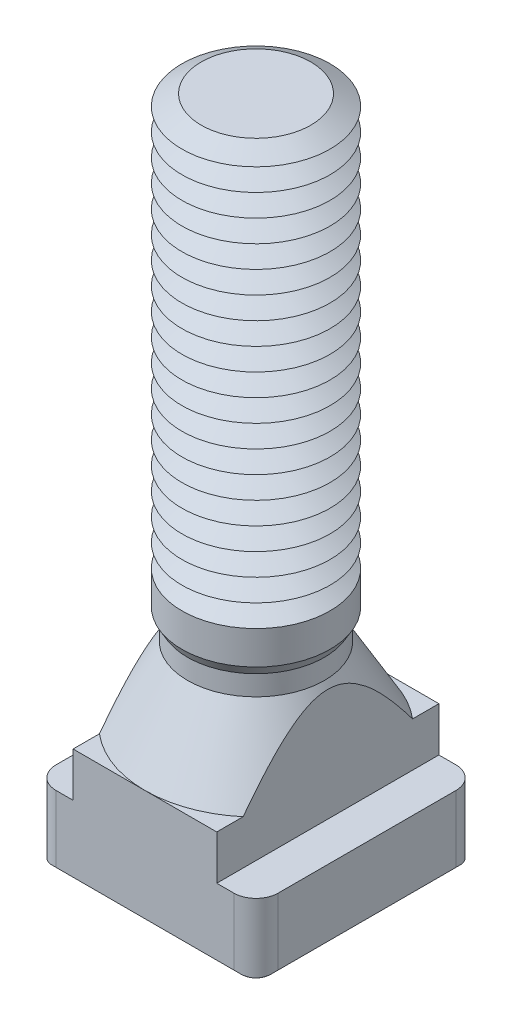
ISO-10303-21;
HEADER;
FILE_DESCRIPTION(('STEP AP214'),'2;1');
FILE_NAME('part.step','',(''),(''),'','','');
FILE_SCHEMA(('AUTOMOTIVE_DESIGN { 1 0 10303 214 1 1 1 1 }'));
ENDSEC;
DATA;
#1=APPLICATION_CONTEXT('core data for automotive mechanical design processes');
#2=APPLICATION_PROTOCOL_DEFINITION('international standard','automotive_design',2000,#1);
#3=PRODUCT_CONTEXT('',#1,'mechanical');
#4=PRODUCT('Part','Part','',(#3));
#5=PRODUCT_RELATED_PRODUCT_CATEGORY('part','',(#4));
#6=PRODUCT_DEFINITION_FORMATION('','',#4);
#7=PRODUCT_DEFINITION_CONTEXT('part definition',#1,'design');
#8=PRODUCT_DEFINITION('design','',#6,#7);
#9=PRODUCT_DEFINITION_SHAPE('','',#8);
#10=(LENGTH_UNIT() NAMED_UNIT(*) SI_UNIT(.MILLI.,.METRE.));
#11=(NAMED_UNIT(*) PLANE_ANGLE_UNIT() SI_UNIT($,.RADIAN.));
#12=(NAMED_UNIT(*) SI_UNIT($,.STERADIAN.) SOLID_ANGLE_UNIT());
#13=UNCERTAINTY_MEASURE_WITH_UNIT(LENGTH_MEASURE(1.E-05),#10,'distance_accuracy_value','');
#14=(GEOMETRIC_REPRESENTATION_CONTEXT(3) GLOBAL_UNCERTAINTY_ASSIGNED_CONTEXT((#13)) GLOBAL_UNIT_ASSIGNED_CONTEXT((#10,
#11,#12)) REPRESENTATION_CONTEXT('',''));
#15=CARTESIAN_POINT('',(0.,0.,0.));
#16=DIRECTION('',(0.,0.,1.));
#17=DIRECTION('',(1.,0.,0.));
#18=AXIS2_PLACEMENT_3D('',#15,#16,#17);
#19=CARTESIAN_POINT('',(0.,40.,0.));
#20=DIRECTION('',(0.,-1.,0.));
#21=DIRECTION('',(0.,0.,-1.));
#22=AXIS2_PLACEMENT_3D('',#19,#20,#21);
#23=CONICAL_SURFACE('',#22,3.70096189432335,1.0471975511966);
#24=CARTESIAN_POINT('',(0.,39.25,0.));
#25=DIRECTION('',(0.,-1.,0.));
#26=DIRECTION('',(0.,0.,-1.));
#27=AXIS2_PLACEMENT_3D('',#24,#25,#26);
#28=CIRCLE('',#27,5.00000000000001);
#29=CARTESIAN_POINT('',(0.,39.25,-5.00000000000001));
#30=VERTEX_POINT('',#29);
#31=EDGE_CURVE('E772',#30,#30,#28,.T.);
#32=ORIENTED_EDGE('',*,*,#31,.F.);
#33=EDGE_LOOP('',(#32));
#34=FACE_BOUND('',#33,.T.);
#35=CARTESIAN_POINT('',(0.,40.,0.));
#36=DIRECTION('',(0.,-1.,0.));
#37=DIRECTION('',(0.,0.,-1.));
#38=AXIS2_PLACEMENT_3D('',#35,#36,#37);
#39=CIRCLE('',#38,3.70096189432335);
#40=CARTESIAN_POINT('',(0.,40.,-3.70096189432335));
#41=VERTEX_POINT('',#40);
#42=EDGE_CURVE('E776',#41,#41,#39,.T.);
#43=ORIENTED_EDGE('',*,*,#42,.T.);
#44=EDGE_LOOP('',(#43));
#45=FACE_BOUND('',#44,.T.);
#46=ADVANCED_FACE('F39',(#34,#45),#23,.T.);
#47=CARTESIAN_POINT('',(0.,40.75,0.));
#48=DIRECTION('',(0.,1.,0.));
#49=DIRECTION('',(0.,0.,1.));
#50=AXIS2_PLACEMENT_3D('',#47,#48,#49);
#51=CONICAL_SURFACE('',#50,5.00000000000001,1.0471975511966);
#52=ORIENTED_EDGE('',*,*,#42,.F.);
#53=EDGE_LOOP('',(#52));
#54=FACE_BOUND('',#53,.T.);
#55=CARTESIAN_POINT('',(0.,40.75,0.));
#56=DIRECTION('',(0.,-1.,0.));
#57=DIRECTION('',(0.,0.,-1.));
#58=AXIS2_PLACEMENT_3D('',#55,#56,#57);
#59=CIRCLE('',#58,5.00000000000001);
#60=CARTESIAN_POINT('',(0.,40.75,-5.00000000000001));
#61=VERTEX_POINT('',#60);
#62=EDGE_CURVE('E780',#61,#61,#59,.T.);
#63=ORIENTED_EDGE('',*,*,#62,.T.);
#64=EDGE_LOOP('',(#63));
#65=FACE_BOUND('',#64,.T.);
#66=ADVANCED_FACE('F450',(#54,#65),#51,.T.);
#67=CARTESIAN_POINT('',(2.493322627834,46.,0.));
#68=DIRECTION('',(0.,-1.,0.));
#69=DIRECTION('',(1.,0.,0.));
#70=AXIS2_PLACEMENT_3D('',#67,#68,#69);
#71=PLANE('',#70);
#72=CARTESIAN_POINT('',(0.,46.,0.));
#73=DIRECTION('',(0.,-1.,0.));
#74=DIRECTION('',(0.,0.,-1.));
#75=AXIS2_PLACEMENT_3D('',#72,#73,#74);
#76=CIRCLE('',#75,3.70096189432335);
#77=CARTESIAN_POINT('',(0.,46.,-3.70096189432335));
#78=VERTEX_POINT('',#77);
#79=EDGE_CURVE('E679',#78,#78,#76,.T.);
#80=ORIENTED_EDGE('',*,*,#79,.F.);
#81=EDGE_LOOP('',(#80));
#82=FACE_BOUND('',#81,.T.);
#83=ADVANCED_FACE('F456',(#82),#71,.F.);
#84=CARTESIAN_POINT('',(0.,46.,0.));
#85=DIRECTION('',(0.,-1.,0.));
#86=DIRECTION('',(0.,0.,-1.));
#87=AXIS2_PLACEMENT_3D('',#84,#85,#86);
#88=CONICAL_SURFACE('',#87,3.70096189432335,1.0471975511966);
#89=CARTESIAN_POINT('',(0.,45.25,0.));
#90=DIRECTION('',(0.,-1.,0.));
#91=DIRECTION('',(0.,0.,-1.));
#92=AXIS2_PLACEMENT_3D('',#89,#90,#91);
#93=CIRCLE('',#92,5.00000000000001);
#94=CARTESIAN_POINT('',(0.,45.25,-5.00000000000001));
#95=VERTEX_POINT('',#94);
#96=EDGE_CURVE('E683',#95,#95,#93,.T.);
#97=ORIENTED_EDGE('',*,*,#96,.F.);
#98=EDGE_LOOP('',(#97));
#99=FACE_BOUND('',#98,.T.);
#100=ORIENTED_EDGE('',*,*,#79,.T.);
#101=EDGE_LOOP('',(#100));
#102=FACE_BOUND('',#101,.T.);
#103=ADVANCED_FACE('F484',(#99,#102),#88,.T.);
#104=CARTESIAN_POINT('',(0.,45.25,0.));
#105=DIRECTION('',(0.,1.,0.));
#106=DIRECTION('',(0.,0.,1.));
#107=AXIS2_PLACEMENT_3D('',#104,#105,#106);
#108=CONICAL_SURFACE('',#107,5.00000000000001,1.0471975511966);
#109=CARTESIAN_POINT('',(0.,44.5,0.));
#110=DIRECTION('',(0.,-1.,0.));
#111=DIRECTION('',(0.,0.,-1.));
#112=AXIS2_PLACEMENT_3D('',#109,#110,#111);
#113=CIRCLE('',#112,3.70096189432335);
#114=CARTESIAN_POINT('',(0.,44.5,-3.70096189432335));
#115=VERTEX_POINT('',#114);
#116=EDGE_CURVE('E793',#115,#115,#113,.T.);
#117=ORIENTED_EDGE('',*,*,#116,.F.);
#118=EDGE_LOOP('',(#117));
#119=FACE_BOUND('',#118,.T.);
#120=ORIENTED_EDGE('',*,*,#96,.T.);
#121=EDGE_LOOP('',(#120));
#122=FACE_BOUND('',#121,.T.);
#123=ADVANCED_FACE('F481',(#119,#122),#108,.T.);
#124=CARTESIAN_POINT('',(0.,44.5,0.));
#125=DIRECTION('',(0.,-1.,0.));
#126=DIRECTION('',(0.,0.,-1.));
#127=AXIS2_PLACEMENT_3D('',#124,#125,#126);
#128=CONICAL_SURFACE('',#127,3.70096189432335,1.0471975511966);
#129=CARTESIAN_POINT('',(0.,43.75,0.));
#130=DIRECTION('',(0.,-1.,0.));
#131=DIRECTION('',(0.,0.,-1.));
#132=AXIS2_PLACEMENT_3D('',#129,#130,#131);
#133=CIRCLE('',#132,5.00000000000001);
#134=CARTESIAN_POINT('',(0.,43.75,-5.00000000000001));
#135=VERTEX_POINT('',#134);
#136=EDGE_CURVE('E688',#135,#135,#133,.T.);
#137=ORIENTED_EDGE('',*,*,#136,.F.);
#138=EDGE_LOOP('',(#137));
#139=FACE_BOUND('',#138,.T.);
#140=ORIENTED_EDGE('',*,*,#116,.T.);
#141=EDGE_LOOP('',(#140));
#142=FACE_BOUND('',#141,.T.);
#143=ADVANCED_FACE('F476',(#139,#142),#128,.T.);
#144=CARTESIAN_POINT('',(0.,43.75,0.));
#145=DIRECTION('',(0.,1.,0.));
#146=DIRECTION('',(0.,0.,1.));
#147=AXIS2_PLACEMENT_3D('',#144,#145,#146);
#148=CONICAL_SURFACE('',#147,5.00000000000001,1.0471975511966);
#149=CARTESIAN_POINT('',(0.,43.,0.));
#150=DIRECTION('',(0.,-1.,0.));
#151=DIRECTION('',(0.,0.,-1.));
#152=AXIS2_PLACEMENT_3D('',#149,#150,#151);
#153=CIRCLE('',#152,3.70096189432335);
#154=CARTESIAN_POINT('',(0.,43.,-3.70096189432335));
#155=VERTEX_POINT('',#154);
#156=EDGE_CURVE('E685',#155,#155,#153,.T.);
#157=ORIENTED_EDGE('',*,*,#156,.F.);
#158=EDGE_LOOP('',(#157));
#159=FACE_BOUND('',#158,.T.);
#160=ORIENTED_EDGE('',*,*,#136,.T.);
#161=EDGE_LOOP('',(#160));
#162=FACE_BOUND('',#161,.T.);
#163=ADVANCED_FACE('F473',(#159,#162),#148,.T.);
#164=CARTESIAN_POINT('',(0.,43.,0.));
#165=DIRECTION('',(0.,-1.,0.));
#166=DIRECTION('',(0.,0.,-1.));
#167=AXIS2_PLACEMENT_3D('',#164,#165,#166);
#168=CONICAL_SURFACE('',#167,3.70096189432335,1.0471975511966);
#169=CARTESIAN_POINT('',(0.,42.25,0.));
#170=DIRECTION('',(0.,-1.,0.));
#171=DIRECTION('',(0.,0.,-1.));
#172=AXIS2_PLACEMENT_3D('',#169,#170,#171);
#173=CIRCLE('',#172,5.00000000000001);
#174=CARTESIAN_POINT('',(0.,42.25,-5.00000000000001));
#175=VERTEX_POINT('',#174);
#176=EDGE_CURVE('E689',#175,#175,#173,.T.);
#177=ORIENTED_EDGE('',*,*,#176,.F.);
#178=EDGE_LOOP('',(#177));
#179=FACE_BOUND('',#178,.T.);
#180=ORIENTED_EDGE('',*,*,#156,.T.);
#181=EDGE_LOOP('',(#180));
#182=FACE_BOUND('',#181,.T.);
#183=ADVANCED_FACE('F467',(#179,#182),#168,.T.);
#184=CARTESIAN_POINT('',(0.,42.25,0.));
#185=DIRECTION('',(0.,1.,0.));
#186=DIRECTION('',(0.,0.,1.));
#187=AXIS2_PLACEMENT_3D('',#184,#185,#186);
#188=CONICAL_SURFACE('',#187,5.00000000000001,1.0471975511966);
#189=CARTESIAN_POINT('',(0.,41.5,0.));
#190=DIRECTION('',(0.,-1.,0.));
#191=DIRECTION('',(0.,0.,-1.));
#192=AXIS2_PLACEMENT_3D('',#189,#190,#191);
#193=CIRCLE('',#192,3.70096189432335);
#194=CARTESIAN_POINT('',(0.,41.5,-3.70096189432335));
#195=VERTEX_POINT('',#194);
#196=EDGE_CURVE('E784',#195,#195,#193,.T.);
#197=ORIENTED_EDGE('',*,*,#196,.F.);
#198=EDGE_LOOP('',(#197));
#199=FACE_BOUND('',#198,.T.);
#200=ORIENTED_EDGE('',*,*,#176,.T.);
#201=EDGE_LOOP('',(#200));
#202=FACE_BOUND('',#201,.T.);
#203=ADVANCED_FACE('F463',(#199,#202),#188,.T.);
#204=CARTESIAN_POINT('',(0.,41.5,0.));
#205=DIRECTION('',(0.,-1.,0.));
#206=DIRECTION('',(0.,0.,-1.));
#207=AXIS2_PLACEMENT_3D('',#204,#205,#206);
#208=CONICAL_SURFACE('',#207,3.70096189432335,1.0471975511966);
#209=ORIENTED_EDGE('',*,*,#62,.F.);
#210=EDGE_LOOP('',(#209));
#211=FACE_BOUND('',#210,.T.);
#212=ORIENTED_EDGE('',*,*,#196,.T.);
#213=EDGE_LOOP('',(#212));
#214=FACE_BOUND('',#213,.T.);
#215=ADVANCED_FACE('F466',(#211,#214),#208,.T.);
#216=CARTESIAN_POINT('',(0.,38.5,0.));
#217=DIRECTION('',(0.,-1.,0.));
#218=DIRECTION('',(0.,0.,-1.));
#219=AXIS2_PLACEMENT_3D('',#216,#217,#218);
#220=CONICAL_SURFACE('',#219,3.70096189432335,1.0471975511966);
#221=CARTESIAN_POINT('',(0.,37.75,0.));
#222=DIRECTION('',(0.,-1.,0.));
#223=DIRECTION('',(0.,0.,-1.));
#224=AXIS2_PLACEMENT_3D('',#221,#222,#223);
#225=CIRCLE('',#224,5.00000000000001);
#226=CARTESIAN_POINT('',(0.,37.75,-5.00000000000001));
#227=VERTEX_POINT('',#226);
#228=EDGE_CURVE('E634',#227,#227,#225,.T.);
#229=ORIENTED_EDGE('',*,*,#228,.F.);
#230=EDGE_LOOP('',(#229));
#231=FACE_BOUND('',#230,.T.);
#232=CARTESIAN_POINT('',(0.,38.5,0.));
#233=DIRECTION('',(0.,-1.,0.));
#234=DIRECTION('',(0.,0.,-1.));
#235=AXIS2_PLACEMENT_3D('',#232,#233,#234);
#236=CIRCLE('',#235,3.70096189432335);
#237=CARTESIAN_POINT('',(0.,38.5,-3.70096189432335));
#238=VERTEX_POINT('',#237);
#239=EDGE_CURVE('E637',#238,#238,#236,.T.);
#240=ORIENTED_EDGE('',*,*,#239,.T.);
#241=EDGE_LOOP('',(#240));
#242=FACE_BOUND('',#241,.T.);
#243=ADVANCED_FACE('F471',(#231,#242),#220,.T.);
#244=CARTESIAN_POINT('',(0.,39.25,0.));
#245=DIRECTION('',(0.,1.,0.));
#246=DIRECTION('',(0.,0.,1.));
#247=AXIS2_PLACEMENT_3D('',#244,#245,#246);
#248=CONICAL_SURFACE('',#247,5.00000000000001,1.0471975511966);
#249=ORIENTED_EDGE('',*,*,#239,.F.);
#250=EDGE_LOOP('',(#249));
#251=FACE_BOUND('',#250,.T.);
#252=ORIENTED_EDGE('',*,*,#31,.T.);
#253=EDGE_LOOP('',(#252));
#254=FACE_BOUND('',#253,.T.);
#255=ADVANCED_FACE('F1155',(#251,#254),#248,.T.);
#256=CARTESIAN_POINT('',(0.,37.,0.));
#257=DIRECTION('',(0.,-1.,0.));
#258=DIRECTION('',(0.,0.,-1.));
#259=AXIS2_PLACEMENT_3D('',#256,#257,#258);
#260=CONICAL_SURFACE('',#259,3.70096189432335,1.0471975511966);
#261=CARTESIAN_POINT('',(0.,36.25,0.));
#262=DIRECTION('',(0.,-1.,0.));
#263=DIRECTION('',(0.,0.,-1.));
#264=AXIS2_PLACEMENT_3D('',#261,#262,#263);
#265=CIRCLE('',#264,5.00000000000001);
#266=CARTESIAN_POINT('',(0.,36.25,-5.00000000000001));
#267=VERTEX_POINT('',#266);
#268=EDGE_CURVE('E660',#267,#267,#265,.T.);
#269=ORIENTED_EDGE('',*,*,#268,.F.);
#270=EDGE_LOOP('',(#269));
#271=FACE_BOUND('',#270,.T.);
#272=CARTESIAN_POINT('',(0.,37.,0.));
#273=DIRECTION('',(0.,-1.,0.));
#274=DIRECTION('',(0.,0.,-1.));
#275=AXIS2_PLACEMENT_3D('',#272,#273,#274);
#276=CIRCLE('',#275,3.70096189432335);
#277=CARTESIAN_POINT('',(0.,37.,-3.70096189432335));
#278=VERTEX_POINT('',#277);
#279=EDGE_CURVE('E638',#278,#278,#276,.T.);
#280=ORIENTED_EDGE('',*,*,#279,.T.);
#281=EDGE_LOOP('',(#280));
#282=FACE_BOUND('',#281,.T.);
#283=ADVANCED_FACE('F1146',(#271,#282),#260,.T.);
#284=CARTESIAN_POINT('',(0.,37.75,0.));
#285=DIRECTION('',(0.,1.,0.));
#286=DIRECTION('',(0.,0.,1.));
#287=AXIS2_PLACEMENT_3D('',#284,#285,#286);
#288=CONICAL_SURFACE('',#287,5.00000000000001,1.0471975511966);
#289=ORIENTED_EDGE('',*,*,#279,.F.);
#290=EDGE_LOOP('',(#289));
#291=FACE_BOUND('',#290,.T.);
#292=ORIENTED_EDGE('',*,*,#228,.T.);
#293=EDGE_LOOP('',(#292));
#294=FACE_BOUND('',#293,.T.);
#295=ADVANCED_FACE('F1137',(#291,#294),#288,.T.);
#296=CARTESIAN_POINT('',(0.,35.5,0.));
#297=DIRECTION('',(0.,-1.,0.));
#298=DIRECTION('',(0.,0.,-1.));
#299=AXIS2_PLACEMENT_3D('',#296,#297,#298);
#300=CONICAL_SURFACE('',#299,3.70096189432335,1.0471975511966);
#301=CARTESIAN_POINT('',(0.,34.75,0.));
#302=DIRECTION('',(0.,-1.,0.));
#303=DIRECTION('',(0.,0.,-1.));
#304=AXIS2_PLACEMENT_3D('',#301,#302,#303);
#305=CIRCLE('',#304,5.00000000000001);
#306=CARTESIAN_POINT('',(0.,34.75,-5.00000000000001));
#307=VERTEX_POINT('',#306);
#308=EDGE_CURVE('E661',#307,#307,#305,.T.);
#309=ORIENTED_EDGE('',*,*,#308,.F.);
#310=EDGE_LOOP('',(#309));
#311=FACE_BOUND('',#310,.T.);
#312=CARTESIAN_POINT('',(0.,35.5,0.));
#313=DIRECTION('',(0.,-1.,0.));
#314=DIRECTION('',(0.,0.,-1.));
#315=AXIS2_PLACEMENT_3D('',#312,#313,#314);
#316=CIRCLE('',#315,3.70096189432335);
#317=CARTESIAN_POINT('',(0.,35.5,-3.70096189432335));
#318=VERTEX_POINT('',#317);
#319=EDGE_CURVE('E657',#318,#318,#316,.T.);
#320=ORIENTED_EDGE('',*,*,#319,.T.);
#321=EDGE_LOOP('',(#320));
#322=FACE_BOUND('',#321,.T.);
#323=ADVANCED_FACE('F1128',(#311,#322),#300,.T.);
#324=CARTESIAN_POINT('',(0.,36.25,0.));
#325=DIRECTION('',(0.,1.,0.));
#326=DIRECTION('',(0.,0.,1.));
#327=AXIS2_PLACEMENT_3D('',#324,#325,#326);
#328=CONICAL_SURFACE('',#327,5.00000000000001,1.0471975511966);
#329=ORIENTED_EDGE('',*,*,#319,.F.);
#330=EDGE_LOOP('',(#329));
#331=FACE_BOUND('',#330,.T.);
#332=ORIENTED_EDGE('',*,*,#268,.T.);
#333=EDGE_LOOP('',(#332));
#334=FACE_BOUND('',#333,.T.);
#335=ADVANCED_FACE('F1119',(#331,#334),#328,.T.);
#336=CARTESIAN_POINT('',(0.,34.,0.));
#337=DIRECTION('',(0.,-1.,0.));
#338=DIRECTION('',(0.,0.,-1.));
#339=AXIS2_PLACEMENT_3D('',#336,#337,#338);
#340=CONICAL_SURFACE('',#339,3.70096189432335,1.0471975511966);
#341=CARTESIAN_POINT('',(0.,33.25,0.));
#342=DIRECTION('',(0.,-1.,0.));
#343=DIRECTION('',(0.,0.,-1.));
#344=AXIS2_PLACEMENT_3D('',#341,#342,#343);
#345=CIRCLE('',#344,5.00000000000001);
#346=CARTESIAN_POINT('',(0.,33.25,-5.00000000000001));
#347=VERTEX_POINT('',#346);
#348=EDGE_CURVE('E672',#347,#347,#345,.T.);
#349=ORIENTED_EDGE('',*,*,#348,.F.);
#350=EDGE_LOOP('',(#349));
#351=FACE_BOUND('',#350,.T.);
#352=CARTESIAN_POINT('',(0.,34.,0.));
#353=DIRECTION('',(0.,-1.,0.));
#354=DIRECTION('',(0.,0.,-1.));
#355=AXIS2_PLACEMENT_3D('',#352,#353,#354);
#356=CIRCLE('',#355,3.70096189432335);
#357=CARTESIAN_POINT('',(0.,34.,-3.70096189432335));
#358=VERTEX_POINT('',#357);
#359=EDGE_CURVE('E759',#358,#358,#356,.T.);
#360=ORIENTED_EDGE('',*,*,#359,.T.);
#361=EDGE_LOOP('',(#360));
#362=FACE_BOUND('',#361,.T.);
#363=ADVANCED_FACE('F1110',(#351,#362),#340,.T.);
#364=CARTESIAN_POINT('',(0.,34.75,0.));
#365=DIRECTION('',(0.,1.,0.));
#366=DIRECTION('',(0.,0.,1.));
#367=AXIS2_PLACEMENT_3D('',#364,#365,#366);
#368=CONICAL_SURFACE('',#367,5.00000000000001,1.0471975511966);
#369=ORIENTED_EDGE('',*,*,#359,.F.);
#370=EDGE_LOOP('',(#369));
#371=FACE_BOUND('',#370,.T.);
#372=ORIENTED_EDGE('',*,*,#308,.T.);
#373=EDGE_LOOP('',(#372));
#374=FACE_BOUND('',#373,.T.);
#375=ADVANCED_FACE('F1101',(#371,#374),#368,.T.);
#376=CARTESIAN_POINT('',(0.,32.5,0.));
#377=DIRECTION('',(0.,-1.,0.));
#378=DIRECTION('',(0.,0.,-1.));
#379=AXIS2_PLACEMENT_3D('',#376,#377,#378);
#380=CONICAL_SURFACE('',#379,3.70096189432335,1.0471975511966);
#381=CARTESIAN_POINT('',(0.,31.75,0.));
#382=DIRECTION('',(0.,-1.,0.));
#383=DIRECTION('',(0.,0.,-1.));
#384=AXIS2_PLACEMENT_3D('',#381,#382,#383);
#385=CIRCLE('',#384,5.00000000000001);
#386=CARTESIAN_POINT('',(0.,31.75,-5.00000000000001));
#387=VERTEX_POINT('',#386);
#388=EDGE_CURVE('E673',#387,#387,#385,.T.);
#389=ORIENTED_EDGE('',*,*,#388,.F.);
#390=EDGE_LOOP('',(#389));
#391=FACE_BOUND('',#390,.T.);
#392=CARTESIAN_POINT('',(0.,32.5,0.));
#393=DIRECTION('',(0.,-1.,0.));
#394=DIRECTION('',(0.,0.,-1.));
#395=AXIS2_PLACEMENT_3D('',#392,#393,#394);
#396=CIRCLE('',#395,3.70096189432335);
#397=CARTESIAN_POINT('',(0.,32.5,-3.70096189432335));
#398=VERTEX_POINT('',#397);
#399=EDGE_CURVE('E669',#398,#398,#396,.T.);
#400=ORIENTED_EDGE('',*,*,#399,.T.);
#401=EDGE_LOOP('',(#400));
#402=FACE_BOUND('',#401,.T.);
#403=ADVANCED_FACE('F1092',(#391,#402),#380,.T.);
#404=CARTESIAN_POINT('',(0.,33.25,0.));
#405=DIRECTION('',(0.,1.,0.));
#406=DIRECTION('',(0.,0.,1.));
#407=AXIS2_PLACEMENT_3D('',#404,#405,#406);
#408=CONICAL_SURFACE('',#407,5.00000000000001,1.0471975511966);
#409=ORIENTED_EDGE('',*,*,#399,.F.);
#410=EDGE_LOOP('',(#409));
#411=FACE_BOUND('',#410,.T.);
#412=ORIENTED_EDGE('',*,*,#348,.T.);
#413=EDGE_LOOP('',(#412));
#414=FACE_BOUND('',#413,.T.);
#415=ADVANCED_FACE('F1083',(#411,#414),#408,.T.);
#416=CARTESIAN_POINT('',(0.,31.,0.));
#417=DIRECTION('',(0.,-1.,0.));
#418=DIRECTION('',(0.,0.,-1.));
#419=AXIS2_PLACEMENT_3D('',#416,#417,#418);
#420=CONICAL_SURFACE('',#419,3.70096189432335,1.0471975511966);
#421=CARTESIAN_POINT('',(0.,30.25,0.));
#422=DIRECTION('',(0.,-1.,0.));
#423=DIRECTION('',(0.,0.,-1.));
#424=AXIS2_PLACEMENT_3D('',#421,#422,#423);
#425=CIRCLE('',#424,5.00000000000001);
#426=CARTESIAN_POINT('',(0.,30.25,-5.00000000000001));
#427=VERTEX_POINT('',#426);
#428=EDGE_CURVE('E746',#427,#427,#425,.T.);
#429=ORIENTED_EDGE('',*,*,#428,.F.);
#430=EDGE_LOOP('',(#429));
#431=FACE_BOUND('',#430,.T.);
#432=CARTESIAN_POINT('',(0.,31.,0.));
#433=DIRECTION('',(0.,-1.,0.));
#434=DIRECTION('',(0.,0.,-1.));
#435=AXIS2_PLACEMENT_3D('',#432,#433,#434);
#436=CIRCLE('',#435,3.70096189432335);
#437=CARTESIAN_POINT('',(0.,31.,-3.70096189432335));
#438=VERTEX_POINT('',#437);
#439=EDGE_CURVE('E750',#438,#438,#436,.T.);
#440=ORIENTED_EDGE('',*,*,#439,.T.);
#441=EDGE_LOOP('',(#440));
#442=FACE_BOUND('',#441,.T.);
#443=ADVANCED_FACE('F1074',(#431,#442),#420,.T.);
#444=CARTESIAN_POINT('',(0.,31.75,0.));
#445=DIRECTION('',(0.,1.,0.));
#446=DIRECTION('',(0.,0.,1.));
#447=AXIS2_PLACEMENT_3D('',#444,#445,#446);
#448=CONICAL_SURFACE('',#447,5.00000000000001,1.0471975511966);
#449=ORIENTED_EDGE('',*,*,#439,.F.);
#450=EDGE_LOOP('',(#449));
#451=FACE_BOUND('',#450,.T.);
#452=ORIENTED_EDGE('',*,*,#388,.T.);
#453=EDGE_LOOP('',(#452));
#454=FACE_BOUND('',#453,.T.);
#455=ADVANCED_FACE('F1065',(#451,#454),#448,.T.);
#456=CARTESIAN_POINT('',(0.,29.5,0.));
#457=DIRECTION('',(0.,-1.,0.));
#458=DIRECTION('',(0.,0.,-1.));
#459=AXIS2_PLACEMENT_3D('',#456,#457,#458);
#460=CONICAL_SURFACE('',#459,3.70096189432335,1.0471975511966);
#461=CARTESIAN_POINT('',(0.,28.75,0.));
#462=DIRECTION('',(0.,-1.,0.));
#463=DIRECTION('',(0.,0.,-1.));
#464=AXIS2_PLACEMENT_3D('',#461,#462,#463);
#465=CIRCLE('',#464,5.00000000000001);
#466=CARTESIAN_POINT('',(0.,28.75,-5.00000000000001));
#467=VERTEX_POINT('',#466);
#468=EDGE_CURVE('E738',#467,#467,#465,.T.);
#469=ORIENTED_EDGE('',*,*,#468,.F.);
#470=EDGE_LOOP('',(#469));
#471=FACE_BOUND('',#470,.T.);
#472=CARTESIAN_POINT('',(0.,29.5,0.));
#473=DIRECTION('',(0.,-1.,0.));
#474=DIRECTION('',(0.,0.,-1.));
#475=AXIS2_PLACEMENT_3D('',#472,#473,#474);
#476=CIRCLE('',#475,3.70096189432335);
#477=CARTESIAN_POINT('',(0.,29.5,-3.70096189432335));
#478=VERTEX_POINT('',#477);
#479=EDGE_CURVE('E742',#478,#478,#476,.T.);
#480=ORIENTED_EDGE('',*,*,#479,.T.);
#481=EDGE_LOOP('',(#480));
#482=FACE_BOUND('',#481,.T.);
#483=ADVANCED_FACE('F1056',(#471,#482),#460,.T.);
#484=CARTESIAN_POINT('',(0.,30.25,0.));
#485=DIRECTION('',(0.,1.,0.));
#486=DIRECTION('',(0.,0.,1.));
#487=AXIS2_PLACEMENT_3D('',#484,#485,#486);
#488=CONICAL_SURFACE('',#487,5.00000000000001,1.0471975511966);
#489=ORIENTED_EDGE('',*,*,#479,.F.);
#490=EDGE_LOOP('',(#489));
#491=FACE_BOUND('',#490,.T.);
#492=ORIENTED_EDGE('',*,*,#428,.T.);
#493=EDGE_LOOP('',(#492));
#494=FACE_BOUND('',#493,.T.);
#495=ADVANCED_FACE('F1047',(#491,#494),#488,.T.);
#496=CARTESIAN_POINT('',(0.,28.,0.));
#497=DIRECTION('',(0.,-1.,0.));
#498=DIRECTION('',(0.,0.,-1.));
#499=AXIS2_PLACEMENT_3D('',#496,#497,#498);
#500=CONICAL_SURFACE('',#499,3.70096189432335,1.0471975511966);
#501=CARTESIAN_POINT('',(0.,27.25,0.));
#502=DIRECTION('',(0.,-1.,0.));
#503=DIRECTION('',(0.,0.,-1.));
#504=AXIS2_PLACEMENT_3D('',#501,#502,#503);
#505=CIRCLE('',#504,5.00000000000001);
#506=CARTESIAN_POINT('',(0.,27.25,-5.00000000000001));
#507=VERTEX_POINT('',#506);
#508=EDGE_CURVE('E694',#507,#507,#505,.T.);
#509=ORIENTED_EDGE('',*,*,#508,.F.);
#510=EDGE_LOOP('',(#509));
#511=FACE_BOUND('',#510,.T.);
#512=CARTESIAN_POINT('',(0.,28.,0.));
#513=DIRECTION('',(0.,-1.,0.));
#514=DIRECTION('',(0.,0.,-1.));
#515=AXIS2_PLACEMENT_3D('',#512,#513,#514);
#516=CIRCLE('',#515,3.70096189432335);
#517=CARTESIAN_POINT('',(0.,28.,-3.70096189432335));
#518=VERTEX_POINT('',#517);
#519=EDGE_CURVE('E697',#518,#518,#516,.T.);
#520=ORIENTED_EDGE('',*,*,#519,.T.);
#521=EDGE_LOOP('',(#520));
#522=FACE_BOUND('',#521,.T.);
#523=ADVANCED_FACE('F1038',(#511,#522),#500,.T.);
#524=CARTESIAN_POINT('',(0.,28.75,0.));
#525=DIRECTION('',(0.,1.,0.));
#526=DIRECTION('',(0.,0.,1.));
#527=AXIS2_PLACEMENT_3D('',#524,#525,#526);
#528=CONICAL_SURFACE('',#527,5.00000000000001,1.0471975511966);
#529=ORIENTED_EDGE('',*,*,#519,.F.);
#530=EDGE_LOOP('',(#529));
#531=FACE_BOUND('',#530,.T.);
#532=ORIENTED_EDGE('',*,*,#468,.T.);
#533=EDGE_LOOP('',(#532));
#534=FACE_BOUND('',#533,.T.);
#535=ADVANCED_FACE('F1029',(#531,#534),#528,.T.);
#536=CARTESIAN_POINT('',(0.,26.5,0.));
#537=DIRECTION('',(0.,-1.,0.));
#538=DIRECTION('',(0.,0.,-1.));
#539=AXIS2_PLACEMENT_3D('',#536,#537,#538);
#540=CONICAL_SURFACE('',#539,3.70096189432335,1.0471975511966);
#541=CARTESIAN_POINT('',(0.,25.75,0.));
#542=DIRECTION('',(0.,-1.,0.));
#543=DIRECTION('',(0.,0.,-1.));
#544=AXIS2_PLACEMENT_3D('',#541,#542,#543);
#545=CIRCLE('',#544,5.00000000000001);
#546=CARTESIAN_POINT('',(0.,25.75,-5.00000000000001));
#547=VERTEX_POINT('',#546);
#548=EDGE_CURVE('E729',#547,#547,#545,.T.);
#549=ORIENTED_EDGE('',*,*,#548,.F.);
#550=EDGE_LOOP('',(#549));
#551=FACE_BOUND('',#550,.T.);
#552=CARTESIAN_POINT('',(0.,26.5,0.));
#553=DIRECTION('',(0.,-1.,0.));
#554=DIRECTION('',(0.,0.,-1.));
#555=AXIS2_PLACEMENT_3D('',#552,#553,#554);
#556=CIRCLE('',#555,3.70096189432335);
#557=CARTESIAN_POINT('',(0.,26.5,-3.70096189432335));
#558=VERTEX_POINT('',#557);
#559=EDGE_CURVE('E698',#558,#558,#556,.T.);
#560=ORIENTED_EDGE('',*,*,#559,.T.);
#561=EDGE_LOOP('',(#560));
#562=FACE_BOUND('',#561,.T.);
#563=ADVANCED_FACE('F1020',(#551,#562),#540,.T.);
#564=CARTESIAN_POINT('',(0.,27.25,0.));
#565=DIRECTION('',(0.,1.,0.));
#566=DIRECTION('',(0.,0.,1.));
#567=AXIS2_PLACEMENT_3D('',#564,#565,#566);
#568=CONICAL_SURFACE('',#567,5.00000000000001,1.0471975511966);
#569=ORIENTED_EDGE('',*,*,#559,.F.);
#570=EDGE_LOOP('',(#569));
#571=FACE_BOUND('',#570,.T.);
#572=ORIENTED_EDGE('',*,*,#508,.T.);
#573=EDGE_LOOP('',(#572));
#574=FACE_BOUND('',#573,.T.);
#575=ADVANCED_FACE('F1011',(#571,#574),#568,.T.);
#576=CARTESIAN_POINT('',(0.,25.,0.));
#577=DIRECTION('',(0.,-1.,0.));
#578=DIRECTION('',(0.,0.,-1.));
#579=AXIS2_PLACEMENT_3D('',#576,#577,#578);
#580=CONICAL_SURFACE('',#579,3.70096189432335,1.0471975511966);
#581=CARTESIAN_POINT('',(0.,24.25,0.));
#582=DIRECTION('',(0.,-1.,0.));
#583=DIRECTION('',(0.,0.,-1.));
#584=AXIS2_PLACEMENT_3D('',#581,#582,#583);
#585=CIRCLE('',#584,5.00000000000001);
#586=CARTESIAN_POINT('',(0.,24.25,-5.00000000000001));
#587=VERTEX_POINT('',#586);
#588=EDGE_CURVE('E721',#587,#587,#585,.T.);
#589=ORIENTED_EDGE('',*,*,#588,.F.);
#590=EDGE_LOOP('',(#589));
#591=FACE_BOUND('',#590,.T.);
#592=CARTESIAN_POINT('',(0.,25.,0.));
#593=DIRECTION('',(0.,-1.,0.));
#594=DIRECTION('',(0.,0.,-1.));
#595=AXIS2_PLACEMENT_3D('',#592,#593,#594);
#596=CIRCLE('',#595,3.70096189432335);
#597=CARTESIAN_POINT('',(0.,25.,-3.70096189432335));
#598=VERTEX_POINT('',#597);
#599=EDGE_CURVE('E725',#598,#598,#596,.T.);
#600=ORIENTED_EDGE('',*,*,#599,.T.);
#601=EDGE_LOOP('',(#600));
#602=FACE_BOUND('',#601,.T.);
#603=ADVANCED_FACE('F1002',(#591,#602),#580,.T.);
#604=CARTESIAN_POINT('',(0.,25.75,0.));
#605=DIRECTION('',(0.,1.,0.));
#606=DIRECTION('',(0.,0.,1.));
#607=AXIS2_PLACEMENT_3D('',#604,#605,#606);
#608=CONICAL_SURFACE('',#607,5.00000000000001,1.0471975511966);
#609=ORIENTED_EDGE('',*,*,#599,.F.);
#610=EDGE_LOOP('',(#609));
#611=FACE_BOUND('',#610,.T.);
#612=ORIENTED_EDGE('',*,*,#548,.T.);
#613=EDGE_LOOP('',(#612));
#614=FACE_BOUND('',#613,.T.);
#615=ADVANCED_FACE('F993',(#611,#614),#608,.T.);
#616=CARTESIAN_POINT('',(0.,23.5,0.));
#617=DIRECTION('',(0.,-1.,0.));
#618=DIRECTION('',(0.,0.,-1.));
#619=AXIS2_PLACEMENT_3D('',#616,#617,#618);
#620=CONICAL_SURFACE('',#619,3.70096189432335,1.0471975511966);
#621=CARTESIAN_POINT('',(0.,22.75,0.));
#622=DIRECTION('',(0.,-1.,0.));
#623=DIRECTION('',(0.,0.,-1.));
#624=AXIS2_PLACEMENT_3D('',#621,#622,#623);
#625=CIRCLE('',#624,5.00000000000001);
#626=CARTESIAN_POINT('',(0.,22.75,-5.00000000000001));
#627=VERTEX_POINT('',#626);
#628=EDGE_CURVE('E708',#627,#627,#625,.T.);
#629=ORIENTED_EDGE('',*,*,#628,.F.);
#630=EDGE_LOOP('',(#629));
#631=FACE_BOUND('',#630,.T.);
#632=CARTESIAN_POINT('',(0.,23.5,0.));
#633=DIRECTION('',(0.,-1.,0.));
#634=DIRECTION('',(0.,0.,-1.));
#635=AXIS2_PLACEMENT_3D('',#632,#633,#634);
#636=CIRCLE('',#635,3.70096189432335);
#637=CARTESIAN_POINT('',(0.,23.5,-3.70096189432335));
#638=VERTEX_POINT('',#637);
#639=EDGE_CURVE('E717',#638,#638,#636,.T.);
#640=ORIENTED_EDGE('',*,*,#639,.T.);
#641=EDGE_LOOP('',(#640));
#642=FACE_BOUND('',#641,.T.);
#643=ADVANCED_FACE('F984',(#631,#642),#620,.T.);
#644=CARTESIAN_POINT('',(0.,24.25,0.));
#645=DIRECTION('',(0.,1.,0.));
#646=DIRECTION('',(0.,0.,1.));
#647=AXIS2_PLACEMENT_3D('',#644,#645,#646);
#648=CONICAL_SURFACE('',#647,5.00000000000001,1.0471975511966);
#649=ORIENTED_EDGE('',*,*,#639,.F.);
#650=EDGE_LOOP('',(#649));
#651=FACE_BOUND('',#650,.T.);
#652=ORIENTED_EDGE('',*,*,#588,.T.);
#653=EDGE_LOOP('',(#652));
#654=FACE_BOUND('',#653,.T.);
#655=ADVANCED_FACE('F975',(#651,#654),#648,.T.);
#656=CARTESIAN_POINT('',(0.,22.,0.));
#657=DIRECTION('',(0.,-1.,0.));
#658=DIRECTION('',(0.,0.,-1.));
#659=AXIS2_PLACEMENT_3D('',#656,#657,#658);
#660=CONICAL_SURFACE('',#659,3.70096189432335,1.0471975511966);
#661=CARTESIAN_POINT('',(0.,21.25,0.));
#662=DIRECTION('',(0.,-1.,0.));
#663=DIRECTION('',(0.,0.,-1.));
#664=AXIS2_PLACEMENT_3D('',#661,#662,#663);
#665=CIRCLE('',#664,5.00000000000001);
#666=CARTESIAN_POINT('',(0.,21.25,-5.00000000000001));
#667=VERTEX_POINT('',#666);
#668=EDGE_CURVE('E700',#667,#667,#665,.T.);
#669=ORIENTED_EDGE('',*,*,#668,.F.);
#670=EDGE_LOOP('',(#669));
#671=FACE_BOUND('',#670,.T.);
#672=CARTESIAN_POINT('',(0.,22.,0.));
#673=DIRECTION('',(0.,-1.,0.));
#674=DIRECTION('',(0.,0.,-1.));
#675=AXIS2_PLACEMENT_3D('',#672,#673,#674);
#676=CIRCLE('',#675,3.70096189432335);
#677=CARTESIAN_POINT('',(0.,22.,-3.70096189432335));
#678=VERTEX_POINT('',#677);
#679=EDGE_CURVE('E702',#678,#678,#676,.T.);
#680=ORIENTED_EDGE('',*,*,#679,.T.);
#681=EDGE_LOOP('',(#680));
#682=FACE_BOUND('',#681,.T.);
#683=ADVANCED_FACE('F966',(#671,#682),#660,.T.);
#684=CARTESIAN_POINT('',(0.,22.75,0.));
#685=DIRECTION('',(0.,1.,0.));
#686=DIRECTION('',(0.,0.,1.));
#687=AXIS2_PLACEMENT_3D('',#684,#685,#686);
#688=CONICAL_SURFACE('',#687,5.00000000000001,1.0471975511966);
#689=ORIENTED_EDGE('',*,*,#679,.F.);
#690=EDGE_LOOP('',(#689));
#691=FACE_BOUND('',#690,.T.);
#692=ORIENTED_EDGE('',*,*,#628,.T.);
#693=EDGE_LOOP('',(#692));
#694=FACE_BOUND('',#693,.T.);
#695=ADVANCED_FACE('F957',(#691,#694),#688,.T.);
#696=CARTESIAN_POINT('',(0.,20.5,0.));
#697=DIRECTION('',(0.,-1.,0.));
#698=DIRECTION('',(0.,0.,-1.));
#699=AXIS2_PLACEMENT_3D('',#696,#697,#698);
#700=CONICAL_SURFACE('',#699,3.70096189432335,1.0471975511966);
#701=CARTESIAN_POINT('',(0.,19.75,0.));
#702=DIRECTION('',(0.,-1.,0.));
#703=DIRECTION('',(0.,0.,-1.));
#704=AXIS2_PLACEMENT_3D('',#701,#702,#703);
#705=CIRCLE('',#704,5.00000000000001);
#706=CARTESIAN_POINT('',(0.,19.75,-5.00000000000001));
#707=VERTEX_POINT('',#706);
#708=EDGE_CURVE('E667',#707,#707,#705,.T.);
#709=ORIENTED_EDGE('',*,*,#708,.F.);
#710=EDGE_LOOP('',(#709));
#711=FACE_BOUND('',#710,.T.);
#712=CARTESIAN_POINT('',(0.,20.5,0.));
#713=DIRECTION('',(0.,-1.,0.));
#714=DIRECTION('',(0.,0.,-1.));
#715=AXIS2_PLACEMENT_3D('',#712,#713,#714);
#716=CIRCLE('',#715,3.70096189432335);
#717=CARTESIAN_POINT('',(0.,20.5,-3.70096189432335));
#718=VERTEX_POINT('',#717);
#719=EDGE_CURVE('E666',#718,#718,#716,.T.);
#720=ORIENTED_EDGE('',*,*,#719,.T.);
#721=EDGE_LOOP('',(#720));
#722=FACE_BOUND('',#721,.T.);
#723=ADVANCED_FACE('F948',(#711,#722),#700,.T.);
#724=CARTESIAN_POINT('',(0.,21.25,0.));
#725=DIRECTION('',(0.,1.,0.));
#726=DIRECTION('',(0.,0.,1.));
#727=AXIS2_PLACEMENT_3D('',#724,#725,#726);
#728=CONICAL_SURFACE('',#727,5.00000000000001,1.0471975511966);
#729=ORIENTED_EDGE('',*,*,#719,.F.);
#730=EDGE_LOOP('',(#729));
#731=FACE_BOUND('',#730,.T.);
#732=ORIENTED_EDGE('',*,*,#668,.T.);
#733=EDGE_LOOP('',(#732));
#734=FACE_BOUND('',#733,.T.);
#735=ADVANCED_FACE('F939',(#731,#734),#728,.T.);
#736=CARTESIAN_POINT('',(0.,19.,0.));
#737=DIRECTION('',(0.,-1.,0.));
#738=DIRECTION('',(0.,0.,-1.));
#739=AXIS2_PLACEMENT_3D('',#736,#737,#738);
#740=CONICAL_SURFACE('',#739,3.70096189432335,1.0471975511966);
#741=CARTESIAN_POINT('',(0.,18.25,0.));
#742=DIRECTION('',(0.,-1.,0.));
#743=DIRECTION('',(0.,0.,-1.));
#744=AXIS2_PLACEMENT_3D('',#741,#742,#743);
#745=CIRCLE('',#744,5.00000000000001);
#746=CARTESIAN_POINT('',(0.,18.25,-5.00000000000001));
#747=VERTEX_POINT('',#746);
#748=EDGE_CURVE('E663',#747,#747,#745,.T.);
#749=ORIENTED_EDGE('',*,*,#748,.F.);
#750=EDGE_LOOP('',(#749));
#751=FACE_BOUND('',#750,.T.);
#752=CARTESIAN_POINT('',(0.,19.,0.));
#753=DIRECTION('',(0.,-1.,0.));
#754=DIRECTION('',(0.,0.,-1.));
#755=AXIS2_PLACEMENT_3D('',#752,#753,#754);
#756=CIRCLE('',#755,3.70096189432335);
#757=CARTESIAN_POINT('',(0.,19.,-3.70096189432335));
#758=VERTEX_POINT('',#757);
#759=EDGE_CURVE('E675',#758,#758,#756,.T.);
#760=ORIENTED_EDGE('',*,*,#759,.T.);
#761=EDGE_LOOP('',(#760));
#762=FACE_BOUND('',#761,.T.);
#763=ADVANCED_FACE('F568',(#751,#762),#740,.T.);
#764=CARTESIAN_POINT('',(0.,19.75,0.));
#765=DIRECTION('',(0.,1.,0.));
#766=DIRECTION('',(0.,0.,1.));
#767=AXIS2_PLACEMENT_3D('',#764,#765,#766);
#768=CONICAL_SURFACE('',#767,5.00000000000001,1.0471975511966);
#769=ORIENTED_EDGE('',*,*,#759,.F.);
#770=EDGE_LOOP('',(#769));
#771=FACE_BOUND('',#770,.T.);
#772=ORIENTED_EDGE('',*,*,#708,.T.);
#773=EDGE_LOOP('',(#772));
#774=FACE_BOUND('',#773,.T.);
#775=ADVANCED_FACE('F563',(#771,#774),#768,.T.);
#776=CARTESIAN_POINT('',(-6.79289321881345,2.9142135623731,-6.79289321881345));
#777=DIRECTION('',(-0.577350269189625,0.577350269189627,-0.577350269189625));
#778=DIRECTION('',(0.,0.707106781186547,0.707106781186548));
#779=AXIS2_PLACEMENT_3D('',#776,#777,#778);
#780=CYLINDRICAL_SURFACE('',#779,1.5);
#781=CARTESIAN_POINT('',(-3.87867965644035,0.,-3.87867965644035));
#782=DIRECTION('',(0.,1.,0.));
#783=DIRECTION('',(-0.707106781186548,0.,-0.707106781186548));
#784=AXIS2_PLACEMENT_3D('',#781,#782,#783);
#785=ELLIPSE('',#784,2.59807621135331,1.5);
#786=CARTESIAN_POINT('',(-5.99999999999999,0.,-4.93933982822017));
#787=VERTEX_POINT('',#786);
#788=CARTESIAN_POINT('',(-4.93933982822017,0.,-5.99999999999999));
#789=VERTEX_POINT('',#788);
#790=EDGE_CURVE('E326',#787,#789,#785,.F.);
#791=ORIENTED_EDGE('',*,*,#790,.F.);
#792=DIRECTION('',(0.577350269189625,-0.577350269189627,0.577350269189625));
#793=VECTOR('',#792,1.);
#794=CARTESIAN_POINT('',(-2.85355339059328,-3.14644660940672,-1.79289321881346));
#795=LINE('',#794,#793);
#796=CARTESIAN_POINT('',(-7.4488887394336,1.44888873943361,-6.38822856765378));
#797=VERTEX_POINT('',#796);
#798=EDGE_CURVE('E367',#797,#787,#795,.T.);
#799=ORIENTED_EDGE('',*,*,#798,.F.);
#800=CARTESIAN_POINT('',(-6.,2.12132034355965,-6.));
#801=DIRECTION('',(0.325057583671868,-0.888073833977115,0.325057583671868));
#802=DIRECTION('',(-0.627963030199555,-0.459700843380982,-0.627963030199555));
#803=AXIS2_PLACEMENT_3D('',#800,#801,#802);
#804=ELLIPSE('',#803,1.68904875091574,1.5);
#805=CARTESIAN_POINT('',(-6.38822856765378,1.44888873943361,-7.4488887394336));
#806=VERTEX_POINT('',#805);
#807=EDGE_CURVE('E264',#797,#806,#804,.T.);
#808=ORIENTED_EDGE('',*,*,#807,.T.);
#809=DIRECTION('',(0.577350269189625,-0.577350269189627,0.577350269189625));
#810=VECTOR('',#809,1.);
#811=CARTESIAN_POINT('',(-6.79289321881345,1.85355339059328,-7.85355339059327));
#812=LINE('',#811,#810);
#813=EDGE_CURVE('E360',#789,#806,#812,.F.);
#814=ORIENTED_EDGE('',*,*,#813,.F.);
#815=EDGE_LOOP('',(#791,#799,#808,#814));
#816=FACE_BOUND('',#815,.T.);
#817=ADVANCED_FACE('F552',(#816),#780,.T.);
#818=CARTESIAN_POINT('',(1.79289321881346,-2.0857864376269,-1.79289321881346));
#819=DIRECTION('',(0.577350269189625,0.577350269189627,-0.577350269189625));
#820=DIRECTION('',(0.,0.707106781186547,0.707106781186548));
#821=AXIS2_PLACEMENT_3D('',#818,#819,#820);
#822=CYLINDRICAL_SURFACE('',#821,1.5);
#823=CARTESIAN_POINT('',(3.87867965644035,0.,-3.87867965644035));
#824=DIRECTION('',(0.,1.,0.));
#825=DIRECTION('',(0.707106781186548,0.,-0.707106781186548));
#826=AXIS2_PLACEMENT_3D('',#823,#824,#825);
#827=ELLIPSE('',#826,2.59807621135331,1.5);
#828=CARTESIAN_POINT('',(4.93933982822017,0.,-5.99999999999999));
#829=VERTEX_POINT('',#828);
#830=CARTESIAN_POINT('',(5.99999999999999,0.,-4.93933982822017));
#831=VERTEX_POINT('',#830);
#832=EDGE_CURVE('E332',#829,#831,#827,.F.);
#833=ORIENTED_EDGE('',*,*,#832,.F.);
#834=DIRECTION('',(-0.577350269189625,-0.577350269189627,0.577350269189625));
#835=VECTOR('',#834,1.);
#836=CARTESIAN_POINT('',(1.79289321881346,-3.14644660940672,-2.85355339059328));
#837=LINE('',#836,#835);
#838=CARTESIAN_POINT('',(6.38822856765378,1.44888873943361,-7.4488887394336));
#839=VERTEX_POINT('',#838);
#840=EDGE_CURVE('E354',#839,#829,#837,.T.);
#841=ORIENTED_EDGE('',*,*,#840,.F.);
#842=CARTESIAN_POINT('',(6.,2.12132034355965,-6.));
#843=DIRECTION('',(-0.325057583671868,-0.888073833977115,0.325057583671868));
#844=DIRECTION('',(0.627963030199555,-0.459700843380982,-0.627963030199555));
#845=AXIS2_PLACEMENT_3D('',#842,#843,#844);
#846=ELLIPSE('',#845,1.68904875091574,1.5);
#847=CARTESIAN_POINT('',(7.4488887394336,1.44888873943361,-6.38822856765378));
#848=VERTEX_POINT('',#847);
#849=EDGE_CURVE('E408',#839,#848,#846,.T.);
#850=ORIENTED_EDGE('',*,*,#849,.T.);
#851=DIRECTION('',(-0.577350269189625,-0.577350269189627,0.577350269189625));
#852=VECTOR('',#851,1.);
#853=CARTESIAN_POINT('',(2.85355339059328,-3.14644660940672,-1.79289321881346));
#854=LINE('',#853,#852);
#855=EDGE_CURVE('E322',#831,#848,#854,.F.);
#856=ORIENTED_EDGE('',*,*,#855,.F.);
#857=EDGE_LOOP('',(#833,#841,#850,#856));
#858=FACE_BOUND('',#857,.T.);
#859=ADVANCED_FACE('F548',(#858),#822,.T.);
#860=CARTESIAN_POINT('',(7.5,0.,-7.5));
#861=DIRECTION('',(0.,1.,0.));
#862=DIRECTION('',(0.,0.,1.));
#863=AXIS2_PLACEMENT_3D('',#860,#861,#862);
#864=PLANE('',#863);
#865=DIRECTION('',(0.,0.,1.));
#866=VECTOR('',#865,1.);
#867=CARTESIAN_POINT('',(5.99999999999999,0.,-7.5));
#868=LINE('',#867,#866);
#869=CARTESIAN_POINT('',(5.99999999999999,0.,4.93933982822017));
#870=VERTEX_POINT('',#869);
#871=EDGE_CURVE('E296',#831,#870,#868,.T.);
#872=ORIENTED_EDGE('',*,*,#871,.T.);
#873=CARTESIAN_POINT('',(3.87867965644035,0.,3.87867965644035));
#874=DIRECTION('',(0.,1.,0.));
#875=DIRECTION('',(-0.707106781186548,0.,-0.707106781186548));
#876=AXIS2_PLACEMENT_3D('',#873,#874,#875);
#877=ELLIPSE('',#876,2.59807621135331,1.5);
#878=CARTESIAN_POINT('',(4.93933982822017,0.,5.99999999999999));
#879=VERTEX_POINT('',#878);
#880=EDGE_CURVE('E335',#870,#879,#877,.F.);
#881=ORIENTED_EDGE('',*,*,#880,.T.);
#882=DIRECTION('',(-1.,0.,0.));
#883=VECTOR('',#882,1.);
#884=CARTESIAN_POINT('',(7.5,0.,5.99999999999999));
#885=LINE('',#884,#883);
#886=CARTESIAN_POINT('',(-4.93933982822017,0.,5.99999999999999));
#887=VERTEX_POINT('',#886);
#888=EDGE_CURVE('E283',#879,#887,#885,.T.);
#889=ORIENTED_EDGE('',*,*,#888,.T.);
#890=CARTESIAN_POINT('',(-3.87867965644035,0.,3.87867965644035));
#891=DIRECTION('',(0.,1.,0.));
#892=DIRECTION('',(0.707106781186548,0.,-0.707106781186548));
#893=AXIS2_PLACEMENT_3D('',#890,#891,#892);
#894=ELLIPSE('',#893,2.59807621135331,1.5);
#895=CARTESIAN_POINT('',(-5.99999999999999,0.,4.93933982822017));
#896=VERTEX_POINT('',#895);
#897=EDGE_CURVE('E329',#887,#896,#894,.F.);
#898=ORIENTED_EDGE('',*,*,#897,.T.);
#899=DIRECTION('',(0.,0.,-1.));
#900=VECTOR('',#899,1.);
#901=CARTESIAN_POINT('',(-5.99999999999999,0.,-7.5));
#902=LINE('',#901,#900);
#903=EDGE_CURVE('E288',#896,#787,#902,.T.);
#904=ORIENTED_EDGE('',*,*,#903,.T.);
#905=ORIENTED_EDGE('',*,*,#790,.T.);
#906=DIRECTION('',(1.,0.,0.));
#907=VECTOR('',#906,1.);
#908=CARTESIAN_POINT('',(7.5,0.,-5.99999999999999));
#909=LINE('',#908,#907);
#910=EDGE_CURVE('E292',#789,#829,#909,.T.);
#911=ORIENTED_EDGE('',*,*,#910,.T.);
#912=ORIENTED_EDGE('',*,*,#832,.T.);
#913=EDGE_LOOP('',(#872,#881,#889,#898,#904,#905,#911,#912));
#914=FACE_BOUND('',#913,.T.);
#915=ADVANCED_FACE('F551',(#914),#864,.F.);
#916=CARTESIAN_POINT('',(-6.79289321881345,2.9142135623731,6.79289321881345));
#917=DIRECTION('',(0.577350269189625,-0.577350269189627,-0.577350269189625));
#918=DIRECTION('',(0.,0.707106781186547,-0.707106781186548));
#919=AXIS2_PLACEMENT_3D('',#916,#917,#918);
#920=CYLINDRICAL_SURFACE('',#919,1.5);
#921=CARTESIAN_POINT('',(-6.,2.12132034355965,6.));
#922=DIRECTION('',(0.325057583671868,-0.888073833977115,-0.325057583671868));
#923=DIRECTION('',(-0.627963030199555,-0.459700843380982,0.627963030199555));
#924=AXIS2_PLACEMENT_3D('',#921,#922,#923);
#925=ELLIPSE('',#924,1.68904875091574,1.5);
#926=CARTESIAN_POINT('',(-6.38822856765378,1.44888873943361,7.4488887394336));
#927=VERTEX_POINT('',#926);
#928=CARTESIAN_POINT('',(-7.4488887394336,1.44888873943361,6.38822856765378));
#929=VERTEX_POINT('',#928);
#930=EDGE_CURVE('E411',#927,#929,#925,.T.);
#931=ORIENTED_EDGE('',*,*,#930,.T.);
#932=DIRECTION('',(-0.577350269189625,0.577350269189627,0.577350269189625));
#933=VECTOR('',#932,1.);
#934=CARTESIAN_POINT('',(-7.85355339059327,1.85355339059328,6.79289321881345));
#935=LINE('',#934,#933);
#936=EDGE_CURVE('E373',#896,#929,#935,.T.);
#937=ORIENTED_EDGE('',*,*,#936,.F.);
#938=ORIENTED_EDGE('',*,*,#897,.F.);
#939=DIRECTION('',(-0.577350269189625,0.577350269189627,0.577350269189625));
#940=VECTOR('',#939,1.);
#941=CARTESIAN_POINT('',(-6.79289321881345,1.85355339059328,7.85355339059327));
#942=LINE('',#941,#940);
#943=EDGE_CURVE('E347',#927,#887,#942,.F.);
#944=ORIENTED_EDGE('',*,*,#943,.F.);
#945=EDGE_LOOP('',(#931,#937,#938,#944));
#946=FACE_BOUND('',#945,.T.);
#947=ADVANCED_FACE('F543',(#946),#920,.T.);
#948=CARTESIAN_POINT('',(-7.5,1.50000000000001,7.5));
#949=DIRECTION('',(0.707106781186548,0.707106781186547,0.));
#950=DIRECTION('',(-0.707106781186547,0.707106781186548,0.));
#951=AXIS2_PLACEMENT_3D('',#948,#949,#950);
#952=PLANE('',#951);
#953=ORIENTED_EDGE('',*,*,#903,.F.);
#954=ORIENTED_EDGE('',*,*,#936,.T.);
#955=CARTESIAN_POINT('',(-6.,0.,6.));
#956=DIRECTION('',(0.707106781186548,0.707106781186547,0.));
#957=DIRECTION('',(0.707106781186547,-0.707106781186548,0.));
#958=AXIS2_PLACEMENT_3D('',#955,#956,#957);
#959=ELLIPSE('',#958,2.12132034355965,1.5);
#960=CARTESIAN_POINT('',(-7.5,1.50000000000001,6.));
#961=VERTEX_POINT('',#960);
#962=EDGE_CURVE('E370',#929,#961,#959,.F.);
#963=ORIENTED_EDGE('',*,*,#962,.T.);
#964=DIRECTION('',(0.,0.,1.));
#965=VECTOR('',#964,1.);
#966=CARTESIAN_POINT('',(-7.5,1.50000000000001,7.5));
#967=LINE('',#966,#965);
#968=CARTESIAN_POINT('',(-7.5,1.50000000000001,-6.));
#969=VERTEX_POINT('',#968);
#970=EDGE_CURVE('E304',#969,#961,#967,.T.);
#971=ORIENTED_EDGE('',*,*,#970,.F.);
#972=CARTESIAN_POINT('',(-6.,0.,-6.));
#973=DIRECTION('',(0.707106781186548,0.707106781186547,0.));
#974=DIRECTION('',(0.707106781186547,-0.707106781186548,0.));
#975=AXIS2_PLACEMENT_3D('',#972,#973,#974);
#976=ELLIPSE('',#975,2.12132034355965,1.5);
#977=EDGE_CURVE('E364',#969,#797,#976,.F.);
#978=ORIENTED_EDGE('',*,*,#977,.T.);
#979=ORIENTED_EDGE('',*,*,#798,.T.);
#980=EDGE_LOOP('',(#953,#954,#963,#971,#978,#979));
#981=FACE_BOUND('',#980,.T.);
#982=ADVANCED_FACE('F530',(#981),#952,.F.);
#983=CARTESIAN_POINT('',(7.5,1.50000000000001,7.5));
#984=DIRECTION('',(-0.707106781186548,0.707106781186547,0.));
#985=DIRECTION('',(-0.707106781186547,-0.707106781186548,0.));
#986=AXIS2_PLACEMENT_3D('',#983,#984,#985);
#987=PLANE('',#986);
#988=ORIENTED_EDGE('',*,*,#871,.F.);
#989=ORIENTED_EDGE('',*,*,#855,.T.);
#990=CARTESIAN_POINT('',(6.,0.,-6.));
#991=DIRECTION('',(-0.707106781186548,0.707106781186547,0.));
#992=DIRECTION('',(-0.707106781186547,-0.707106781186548,0.));
#993=AXIS2_PLACEMENT_3D('',#990,#991,#992);
#994=ELLIPSE('',#993,2.12132034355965,1.5);
#995=CARTESIAN_POINT('',(7.5,1.50000000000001,-6.));
#996=VERTEX_POINT('',#995);
#997=EDGE_CURVE('E319',#848,#996,#994,.F.);
#998=ORIENTED_EDGE('',*,*,#997,.T.);
#999=DIRECTION('',(0.,0.,-1.));
#1000=VECTOR('',#999,1.);
#1001=CARTESIAN_POINT('',(7.5,1.50000000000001,7.5));
#1002=LINE('',#1001,#1000);
#1003=CARTESIAN_POINT('',(7.5,1.50000000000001,6.));
#1004=VERTEX_POINT('',#1003);
#1005=EDGE_CURVE('E279',#1004,#996,#1002,.T.);
#1006=ORIENTED_EDGE('',*,*,#1005,.F.);
#1007=CARTESIAN_POINT('',(6.,0.,6.));
#1008=DIRECTION('',(-0.707106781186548,0.707106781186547,0.));
#1009=DIRECTION('',(-0.707106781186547,-0.707106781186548,0.));
#1010=AXIS2_PLACEMENT_3D('',#1007,#1008,#1009);
#1011=ELLIPSE('',#1010,2.12132034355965,1.5);
#1012=CARTESIAN_POINT('',(7.4488887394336,1.44888873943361,6.38822856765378));
#1013=VERTEX_POINT('',#1012);
#1014=EDGE_CURVE('E312',#1004,#1013,#1011,.F.);
#1015=ORIENTED_EDGE('',*,*,#1014,.T.);
#1016=DIRECTION('',(0.577350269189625,0.577350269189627,0.577350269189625));
#1017=VECTOR('',#1016,1.);
#1018=CARTESIAN_POINT('',(7.85355339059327,1.85355339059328,6.79289321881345));
#1019=LINE('',#1018,#1017);
#1020=EDGE_CURVE('E315',#1013,#870,#1019,.F.);
#1021=ORIENTED_EDGE('',*,*,#1020,.T.);
#1022=EDGE_LOOP('',(#988,#989,#998,#1006,#1015,#1021));
#1023=FACE_BOUND('',#1022,.T.);
#1024=ADVANCED_FACE('F527',(#1023),#987,.F.);
#1025=CARTESIAN_POINT('',(6.79289321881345,2.9142135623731,6.79289321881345));
#1026=DIRECTION('',(-0.577350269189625,-0.577350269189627,-0.577350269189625));
#1027=DIRECTION('',(0.,0.707106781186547,-0.707106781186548));
#1028=AXIS2_PLACEMENT_3D('',#1025,#1026,#1027);
#1029=CYLINDRICAL_SURFACE('',#1028,1.5);
#1030=CARTESIAN_POINT('',(6.,2.12132034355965,6.));
#1031=DIRECTION('',(-0.325057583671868,-0.888073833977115,-0.325057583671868));
#1032=DIRECTION('',(0.627963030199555,-0.459700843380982,0.627963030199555));
#1033=AXIS2_PLACEMENT_3D('',#1030,#1031,#1032);
#1034=ELLIPSE('',#1033,1.68904875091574,1.5);
#1035=CARTESIAN_POINT('',(6.38822856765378,1.44888873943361,7.4488887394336));
#1036=VERTEX_POINT('',#1035);
#1037=EDGE_CURVE('E269',#1013,#1036,#1034,.T.);
#1038=ORIENTED_EDGE('',*,*,#1037,.T.);
#1039=DIRECTION('',(0.577350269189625,0.577350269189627,0.577350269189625));
#1040=VECTOR('',#1039,1.);
#1041=CARTESIAN_POINT('',(1.79289321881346,-3.14644660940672,2.85355339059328));
#1042=LINE('',#1041,#1040);
#1043=EDGE_CURVE('E341',#879,#1036,#1042,.T.);
#1044=ORIENTED_EDGE('',*,*,#1043,.F.);
#1045=ORIENTED_EDGE('',*,*,#880,.F.);
#1046=ORIENTED_EDGE('',*,*,#1020,.F.);
#1047=EDGE_LOOP('',(#1038,#1044,#1045,#1046));
#1048=FACE_BOUND('',#1047,.T.);
#1049=ADVANCED_FACE('F524',(#1048),#1029,.T.);
#1050=CARTESIAN_POINT('',(-7.5,9.,7.5));
#1051=DIRECTION('',(1.,0.,0.));
#1052=DIRECTION('',(0.,0.,-1.));
#1053=AXIS2_PLACEMENT_3D('',#1050,#1051,#1052);
#1054=PLANE('',#1053);
#1055=DIRECTION('',(0.,-1.,0.));
#1056=VECTOR('',#1055,1.);
#1057=CARTESIAN_POINT('',(-7.5,9.,6.));
#1058=LINE('',#1057,#1056);
#1059=CARTESIAN_POINT('',(-7.5,6.,6.));
#1060=VERTEX_POINT('',#1059);
#1061=EDGE_CURVE('E386',#961,#1060,#1058,.F.);
#1062=ORIENTED_EDGE('',*,*,#1061,.T.);
#1063=DIRECTION('',(0.,0.,-1.));
#1064=VECTOR('',#1063,1.);
#1065=CARTESIAN_POINT('',(-7.5,6.,7.5));
#1066=LINE('',#1065,#1064);
#1067=CARTESIAN_POINT('',(-7.5,6.,-6.));
#1068=VERTEX_POINT('',#1067);
#1069=EDGE_CURVE('E231',#1060,#1068,#1066,.T.);
#1070=ORIENTED_EDGE('',*,*,#1069,.T.);
#1071=DIRECTION('',(0.,-1.,0.));
#1072=VECTOR('',#1071,1.);
#1073=CARTESIAN_POINT('',(-7.5,9.,-6.));
#1074=LINE('',#1073,#1072);
#1075=EDGE_CURVE('E383',#1068,#969,#1074,.T.);
#1076=ORIENTED_EDGE('',*,*,#1075,.T.);
#1077=ORIENTED_EDGE('',*,*,#970,.T.);
#1078=EDGE_LOOP('',(#1062,#1070,#1076,#1077));
#1079=FACE_BOUND('',#1078,.T.);
#1080=ADVANCED_FACE('F522',(#1079),#1054,.F.);
#1081=CARTESIAN_POINT('',(-6.,9.,-6.));
#1082=DIRECTION('',(0.,-1.,0.));
#1083=DIRECTION('',(0.,0.,-1.));
#1084=AXIS2_PLACEMENT_3D('',#1081,#1082,#1083);
#1085=CYLINDRICAL_SURFACE('',#1084,1.5);
#1086=CARTESIAN_POINT('',(-6.,6.,-6.));
#1087=DIRECTION('',(0.,-1.,0.));
#1088=DIRECTION('',(1.,0.,0.));
#1089=AXIS2_PLACEMENT_3D('',#1086,#1087,#1088);
#1090=CIRCLE('',#1089,1.5);
#1091=CARTESIAN_POINT('',(-6.,6.,-7.5));
#1092=VERTEX_POINT('',#1091);
#1093=EDGE_CURVE('E404',#1092,#1068,#1090,.F.);
#1094=ORIENTED_EDGE('',*,*,#1093,.F.);
#1095=DIRECTION('',(0.,-1.,0.));
#1096=VECTOR('',#1095,1.);
#1097=CARTESIAN_POINT('',(-6.,9.,-7.5));
#1098=LINE('',#1097,#1096);
#1099=CARTESIAN_POINT('',(-6.,1.50000000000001,-7.5));
#1100=VERTEX_POINT('',#1099);
#1101=EDGE_CURVE('E393',#1100,#1092,#1098,.F.);
#1102=ORIENTED_EDGE('',*,*,#1101,.F.);
#1103=CARTESIAN_POINT('',(-6.,0.,-6.));
#1104=DIRECTION('',(0.,0.707106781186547,0.707106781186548));
#1105=DIRECTION('',(0.,-0.707106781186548,0.707106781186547));
#1106=AXIS2_PLACEMENT_3D('',#1103,#1104,#1105);
#1107=ELLIPSE('',#1106,2.12132034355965,1.5);
#1108=EDGE_CURVE('E357',#806,#1100,#1107,.F.);
#1109=ORIENTED_EDGE('',*,*,#1108,.F.);
#1110=ORIENTED_EDGE('',*,*,#807,.F.);
#1111=ORIENTED_EDGE('',*,*,#977,.F.);
#1112=ORIENTED_EDGE('',*,*,#1075,.F.);
#1113=EDGE_LOOP('',(#1094,#1102,#1109,#1110,#1111,#1112));
#1114=FACE_BOUND('',#1113,.T.);
#1115=ADVANCED_FACE('F41',(#1114),#1085,.T.);
#1116=CARTESIAN_POINT('',(-7.5,1.50000000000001,-7.5));
#1117=DIRECTION('',(0.,0.707106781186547,0.707106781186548));
#1118=DIRECTION('',(0.,-0.707106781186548,0.707106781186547));
#1119=AXIS2_PLACEMENT_3D('',#1116,#1117,#1118);
#1120=PLANE('',#1119);
#1121=ORIENTED_EDGE('',*,*,#910,.F.);
#1122=ORIENTED_EDGE('',*,*,#813,.T.);
#1123=ORIENTED_EDGE('',*,*,#1108,.T.);
#1124=DIRECTION('',(-1.,0.,0.));
#1125=VECTOR('',#1124,1.);
#1126=CARTESIAN_POINT('',(-7.5,1.50000000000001,-7.5));
#1127=LINE('',#1126,#1125);
#1128=CARTESIAN_POINT('',(6.,1.50000000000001,-7.5));
#1129=VERTEX_POINT('',#1128);
#1130=EDGE_CURVE('E300',#1129,#1100,#1127,.T.);
#1131=ORIENTED_EDGE('',*,*,#1130,.F.);
#1132=CARTESIAN_POINT('',(6.,0.,-6.));
#1133=DIRECTION('',(0.,0.707106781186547,0.707106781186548));
#1134=DIRECTION('',(0.,-0.707106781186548,0.707106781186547));
#1135=AXIS2_PLACEMENT_3D('',#1132,#1133,#1134);
#1136=ELLIPSE('',#1135,2.12132034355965,1.5);
#1137=EDGE_CURVE('E351',#1129,#839,#1136,.F.);
#1138=ORIENTED_EDGE('',*,*,#1137,.T.);
#1139=ORIENTED_EDGE('',*,*,#840,.T.);
#1140=EDGE_LOOP('',(#1121,#1122,#1123,#1131,#1138,#1139));
#1141=FACE_BOUND('',#1140,.T.);
#1142=ADVANCED_FACE('F532',(#1141),#1120,.F.);
#1143=CARTESIAN_POINT('',(6.,9.,-6.));
#1144=DIRECTION('',(0.,-1.,0.));
#1145=DIRECTION('',(0.,0.,-1.));
#1146=AXIS2_PLACEMENT_3D('',#1143,#1144,#1145);
#1147=CYLINDRICAL_SURFACE('',#1146,1.5);
#1148=CARTESIAN_POINT('',(6.,6.,-6.));
#1149=DIRECTION('',(0.,-1.,0.));
#1150=DIRECTION('',(1.,0.,0.));
#1151=AXIS2_PLACEMENT_3D('',#1148,#1149,#1150);
#1152=CIRCLE('',#1151,1.5);
#1153=CARTESIAN_POINT('',(7.5,6.,-6.));
#1154=VERTEX_POINT('',#1153);
#1155=CARTESIAN_POINT('',(6.,6.,-7.5));
#1156=VERTEX_POINT('',#1155);
#1157=EDGE_CURVE('E53',#1154,#1156,#1152,.F.);
#1158=ORIENTED_EDGE('',*,*,#1157,.F.);
#1159=DIRECTION('',(0.,-1.,0.));
#1160=VECTOR('',#1159,1.);
#1161=CARTESIAN_POINT('',(7.5,9.,-6.));
#1162=LINE('',#1161,#1160);
#1163=EDGE_CURVE('E400',#996,#1154,#1162,.F.);
#1164=ORIENTED_EDGE('',*,*,#1163,.F.);
#1165=ORIENTED_EDGE('',*,*,#997,.F.);
#1166=ORIENTED_EDGE('',*,*,#849,.F.);
#1167=ORIENTED_EDGE('',*,*,#1137,.F.);
#1168=DIRECTION('',(0.,-1.,0.));
#1169=VECTOR('',#1168,1.);
#1170=CARTESIAN_POINT('',(6.,9.,-7.5));
#1171=LINE('',#1170,#1169);
#1172=EDGE_CURVE('E390',#1156,#1129,#1171,.T.);
#1173=ORIENTED_EDGE('',*,*,#1172,.F.);
#1174=EDGE_LOOP('',(#1158,#1164,#1165,#1166,#1167,#1173));
#1175=FACE_BOUND('',#1174,.T.);
#1176=ADVANCED_FACE('F535',(#1175),#1147,.T.);
#1177=CARTESIAN_POINT('',(7.5,9.,7.5));
#1178=DIRECTION('',(-1.,0.,0.));
#1179=DIRECTION('',(0.,0.,1.));
#1180=AXIS2_PLACEMENT_3D('',#1177,#1178,#1179);
#1181=PLANE('',#1180);
#1182=ORIENTED_EDGE('',*,*,#1163,.T.);
#1183=DIRECTION('',(0.,0.,1.));
#1184=VECTOR('',#1183,1.);
#1185=CARTESIAN_POINT('',(7.5,6.,7.5));
#1186=LINE('',#1185,#1184);
#1187=CARTESIAN_POINT('',(7.5,6.,6.));
#1188=VERTEX_POINT('',#1187);
#1189=EDGE_CURVE('E60',#1154,#1188,#1186,.T.);
#1190=ORIENTED_EDGE('',*,*,#1189,.T.);
#1191=DIRECTION('',(0.,-1.,0.));
#1192=VECTOR('',#1191,1.);
#1193=CARTESIAN_POINT('',(7.5,9.,6.));
#1194=LINE('',#1193,#1192);
#1195=EDGE_CURVE('E397',#1188,#1004,#1194,.T.);
#1196=ORIENTED_EDGE('',*,*,#1195,.T.);
#1197=ORIENTED_EDGE('',*,*,#1005,.T.);
#1198=EDGE_LOOP('',(#1182,#1190,#1196,#1197));
#1199=FACE_BOUND('',#1198,.T.);
#1200=ADVANCED_FACE('F520',(#1199),#1181,.F.);
#1201=CARTESIAN_POINT('',(-7.5,1.50000000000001,7.5));
#1202=DIRECTION('',(0.,0.707106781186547,-0.707106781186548));
#1203=DIRECTION('',(0.,0.707106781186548,0.707106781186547));
#1204=AXIS2_PLACEMENT_3D('',#1201,#1202,#1203);
#1205=PLANE('',#1204);
#1206=CARTESIAN_POINT('',(-6.,0.,6.));
#1207=DIRECTION('',(0.,0.707106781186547,-0.707106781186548));
#1208=DIRECTION('',(0.,-0.707106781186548,-0.707106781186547));
#1209=AXIS2_PLACEMENT_3D('',#1206,#1207,#1208);
#1210=ELLIPSE('',#1209,2.12132034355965,1.5);
#1211=CARTESIAN_POINT('',(-6.,1.50000000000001,7.5));
#1212=VERTEX_POINT('',#1211);
#1213=EDGE_CURVE('E344',#1212,#927,#1210,.F.);
#1214=ORIENTED_EDGE('',*,*,#1213,.T.);
#1215=ORIENTED_EDGE('',*,*,#943,.T.);
#1216=ORIENTED_EDGE('',*,*,#888,.F.);
#1217=ORIENTED_EDGE('',*,*,#1043,.T.);
#1218=CARTESIAN_POINT('',(6.,0.,6.));
#1219=DIRECTION('',(0.,0.707106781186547,-0.707106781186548));
#1220=DIRECTION('',(0.,-0.707106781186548,-0.707106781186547));
#1221=AXIS2_PLACEMENT_3D('',#1218,#1219,#1220);
#1222=ELLIPSE('',#1221,2.12132034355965,1.5);
#1223=CARTESIAN_POINT('',(6.,1.50000000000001,7.5));
#1224=VERTEX_POINT('',#1223);
#1225=EDGE_CURVE('E338',#1036,#1224,#1222,.F.);
#1226=ORIENTED_EDGE('',*,*,#1225,.T.);
#1227=DIRECTION('',(1.,0.,0.));
#1228=VECTOR('',#1227,1.);
#1229=CARTESIAN_POINT('',(-7.5,1.50000000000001,7.5));
#1230=LINE('',#1229,#1228);
#1231=EDGE_CURVE('E308',#1212,#1224,#1230,.T.);
#1232=ORIENTED_EDGE('',*,*,#1231,.F.);
#1233=EDGE_LOOP('',(#1214,#1215,#1216,#1217,#1226,#1232));
#1234=FACE_BOUND('',#1233,.T.);
#1235=ADVANCED_FACE('F537',(#1234),#1205,.F.);
#1236=CARTESIAN_POINT('',(-6.,9.,6.));
#1237=DIRECTION('',(0.,-1.,0.));
#1238=DIRECTION('',(0.,0.,-1.));
#1239=AXIS2_PLACEMENT_3D('',#1236,#1237,#1238);
#1240=CYLINDRICAL_SURFACE('',#1239,1.5);
#1241=CARTESIAN_POINT('',(-6.,6.,6.));
#1242=DIRECTION('',(0.,-1.,0.));
#1243=DIRECTION('',(1.,0.,0.));
#1244=AXIS2_PLACEMENT_3D('',#1241,#1242,#1243);
#1245=CIRCLE('',#1244,1.5);
#1246=CARTESIAN_POINT('',(-6.,6.,7.5));
#1247=VERTEX_POINT('',#1246);
#1248=EDGE_CURVE('E243',#1060,#1247,#1245,.F.);
#1249=ORIENTED_EDGE('',*,*,#1248,.F.);
#1250=ORIENTED_EDGE('',*,*,#1061,.F.);
#1251=ORIENTED_EDGE('',*,*,#962,.F.);
#1252=ORIENTED_EDGE('',*,*,#930,.F.);
#1253=ORIENTED_EDGE('',*,*,#1213,.F.);
#1254=DIRECTION('',(0.,-1.,0.));
#1255=VECTOR('',#1254,1.);
#1256=CARTESIAN_POINT('',(-6.,9.,7.5));
#1257=LINE('',#1256,#1255);
#1258=EDGE_CURVE('E380',#1247,#1212,#1257,.T.);
#1259=ORIENTED_EDGE('',*,*,#1258,.F.);
#1260=EDGE_LOOP('',(#1249,#1250,#1251,#1252,#1253,#1259));
#1261=FACE_BOUND('',#1260,.T.);
#1262=ADVANCED_FACE('F446',(#1261),#1240,.T.);
#1263=CARTESIAN_POINT('',(6.,9.,6.));
#1264=DIRECTION('',(0.,-1.,0.));
#1265=DIRECTION('',(0.,0.,-1.));
#1266=AXIS2_PLACEMENT_3D('',#1263,#1264,#1265);
#1267=CYLINDRICAL_SURFACE('',#1266,1.5);
#1268=CARTESIAN_POINT('',(6.,6.,6.));
#1269=DIRECTION('',(0.,-1.,0.));
#1270=DIRECTION('',(1.,0.,0.));
#1271=AXIS2_PLACEMENT_3D('',#1268,#1269,#1270);
#1272=CIRCLE('',#1271,1.5);
#1273=CARTESIAN_POINT('',(6.,6.,7.5));
#1274=VERTEX_POINT('',#1273);
#1275=EDGE_CURVE('E209',#1274,#1188,#1272,.F.);
#1276=ORIENTED_EDGE('',*,*,#1275,.F.);
#1277=DIRECTION('',(0.,-1.,0.));
#1278=VECTOR('',#1277,1.);
#1279=CARTESIAN_POINT('',(6.,9.,7.5));
#1280=LINE('',#1279,#1278);
#1281=EDGE_CURVE('E376',#1224,#1274,#1280,.F.);
#1282=ORIENTED_EDGE('',*,*,#1281,.F.);
#1283=ORIENTED_EDGE('',*,*,#1225,.F.);
#1284=ORIENTED_EDGE('',*,*,#1037,.F.);
#1285=ORIENTED_EDGE('',*,*,#1014,.F.);
#1286=ORIENTED_EDGE('',*,*,#1195,.F.);
#1287=EDGE_LOOP('',(#1276,#1282,#1283,#1284,#1285,#1286));
#1288=FACE_BOUND('',#1287,.T.);
#1289=ADVANCED_FACE('F440',(#1288),#1267,.T.);
#1290=CARTESIAN_POINT('',(-54.85,6.,-50.));
#1291=DIRECTION('',(0.,-1.,0.));
#1292=DIRECTION('',(1.,0.,0.));
#1293=AXIS2_PLACEMENT_3D('',#1290,#1291,#1292);
#1294=PLANE('',#1293);
#1295=DIRECTION('',(0.,0.,1.));
#1296=VECTOR('',#1295,1.);
#1297=CARTESIAN_POINT('',(-4.85,6.,-50.));
#1298=LINE('',#1297,#1296);
#1299=CARTESIAN_POINT('',(-4.85,6.,-7.5));
#1300=VERTEX_POINT('',#1299);
#1301=CARTESIAN_POINT('',(-4.85,6.,7.5));
#1302=VERTEX_POINT('',#1301);
#1303=EDGE_CURVE('E225',#1300,#1302,#1298,.T.);
#1304=ORIENTED_EDGE('',*,*,#1303,.F.);
#1305=DIRECTION('',(1.,0.,0.));
#1306=VECTOR('',#1305,1.);
#1307=CARTESIAN_POINT('',(-7.5,6.,-7.5));
#1308=LINE('',#1307,#1306);
#1309=EDGE_CURVE('E68',#1092,#1300,#1308,.T.);
#1310=ORIENTED_EDGE('',*,*,#1309,.F.);
#1311=ORIENTED_EDGE('',*,*,#1093,.T.);
#1312=ORIENTED_EDGE('',*,*,#1069,.F.);
#1313=ORIENTED_EDGE('',*,*,#1248,.T.);
#1314=DIRECTION('',(-1.,0.,0.));
#1315=VECTOR('',#1314,1.);
#1316=CARTESIAN_POINT('',(-7.5,6.,7.5));
#1317=LINE('',#1316,#1315);
#1318=EDGE_CURVE('E246',#1302,#1247,#1317,.T.);
#1319=ORIENTED_EDGE('',*,*,#1318,.F.);
#1320=EDGE_LOOP('',(#1304,#1310,#1311,#1312,#1313,#1319));
#1321=FACE_BOUND('',#1320,.T.);
#1322=ADVANCED_FACE('F438',(#1321),#1294,.F.);
#1323=CARTESIAN_POINT('',(-7.5,9.,-7.5));
#1324=DIRECTION('',(0.,0.,1.));
#1325=DIRECTION('',(1.,0.,0.));
#1326=AXIS2_PLACEMENT_3D('',#1323,#1324,#1325);
#1327=PLANE('',#1326);
#1328=DIRECTION('',(0.,-1.,0.));
#1329=VECTOR('',#1328,1.);
#1330=CARTESIAN_POINT('',(4.85,9.,-7.5));
#1331=LINE('',#1330,#1329);
#1332=CARTESIAN_POINT('',(4.85,9.,-7.5));
#1333=VERTEX_POINT('',#1332);
#1334=CARTESIAN_POINT('',(4.85,6.,-7.5));
#1335=VERTEX_POINT('',#1334);
#1336=EDGE_CURVE('E213',#1333,#1335,#1331,.T.);
#1337=ORIENTED_EDGE('',*,*,#1336,.T.);
#1338=DIRECTION('',(1.,0.,0.));
#1339=VECTOR('',#1338,1.);
#1340=CARTESIAN_POINT('',(-7.5,6.,-7.5));
#1341=LINE('',#1340,#1339);
#1342=EDGE_CURVE('E200',#1335,#1156,#1341,.T.);
#1343=ORIENTED_EDGE('',*,*,#1342,.T.);
#1344=ORIENTED_EDGE('',*,*,#1172,.T.);
#1345=ORIENTED_EDGE('',*,*,#1130,.T.);
#1346=ORIENTED_EDGE('',*,*,#1101,.T.);
#1347=ORIENTED_EDGE('',*,*,#1309,.T.);
#1348=DIRECTION('',(0.,1.,0.));
#1349=VECTOR('',#1348,1.);
#1350=CARTESIAN_POINT('',(-4.85,9.,-7.5));
#1351=LINE('',#1350,#1349);
#1352=CARTESIAN_POINT('',(-4.85,9.,-7.5));
#1353=VERTEX_POINT('',#1352);
#1354=EDGE_CURVE('E260',#1300,#1353,#1351,.T.);
#1355=ORIENTED_EDGE('',*,*,#1354,.T.);
#1356=DIRECTION('',(-1.,0.,0.));
#1357=VECTOR('',#1356,1.);
#1358=CARTESIAN_POINT('',(-7.5,9.,-7.5));
#1359=LINE('',#1358,#1357);
#1360=CARTESIAN_POINT('',(0.,9.,-7.5));
#1361=VERTEX_POINT('',#1360);
#1362=EDGE_CURVE('E268',#1361,#1353,#1359,.T.);
#1363=ORIENTED_EDGE('',*,*,#1362,.F.);
#1364=EDGE_CURVE('E223',#1333,#1361,#1359,.T.);
#1365=ORIENTED_EDGE('',*,*,#1364,.F.);
#1366=EDGE_LOOP('',(#1337,#1343,#1344,#1345,#1346,#1347,#1355,#1363,#1365));
#1367=FACE_BOUND('',#1366,.T.);
#1368=ADVANCED_FACE('F221',(#1367),#1327,.F.);
#1369=CARTESIAN_POINT('',(54.85,6.,-50.));
#1370=DIRECTION('',(0.,-1.,0.));
#1371=DIRECTION('',(1.,0.,0.));
#1372=AXIS2_PLACEMENT_3D('',#1369,#1370,#1371);
#1373=PLANE('',#1372);
#1374=ORIENTED_EDGE('',*,*,#1275,.T.);
#1375=ORIENTED_EDGE('',*,*,#1189,.F.);
#1376=ORIENTED_EDGE('',*,*,#1157,.T.);
#1377=ORIENTED_EDGE('',*,*,#1342,.F.);
#1378=DIRECTION('',(0.,0.,1.));
#1379=VECTOR('',#1378,1.);
#1380=CARTESIAN_POINT('',(4.85,6.,-50.));
#1381=LINE('',#1380,#1379);
#1382=CARTESIAN_POINT('',(4.85,6.,7.5));
#1383=VERTEX_POINT('',#1382);
#1384=EDGE_CURVE('E203',#1335,#1383,#1381,.T.);
#1385=ORIENTED_EDGE('',*,*,#1384,.T.);
#1386=DIRECTION('',(-1.,0.,0.));
#1387=VECTOR('',#1386,1.);
#1388=CARTESIAN_POINT('',(-7.5,6.,7.5));
#1389=LINE('',#1388,#1387);
#1390=EDGE_CURVE('E615',#1274,#1383,#1389,.T.);
#1391=ORIENTED_EDGE('',*,*,#1390,.F.);
#1392=EDGE_LOOP('',(#1374,#1375,#1376,#1377,#1385,#1391));
#1393=FACE_BOUND('',#1392,.T.);
#1394=ADVANCED_FACE('F202',(#1393),#1373,.F.);
#1395=CARTESIAN_POINT('',(-7.5,9.,7.5));
#1396=DIRECTION('',(0.,0.,-1.));
#1397=DIRECTION('',(-1.,0.,0.));
#1398=AXIS2_PLACEMENT_3D('',#1395,#1396,#1397);
#1399=PLANE('',#1398);
#1400=ORIENTED_EDGE('',*,*,#1281,.T.);
#1401=ORIENTED_EDGE('',*,*,#1390,.T.);
#1402=DIRECTION('',(0.,1.,0.));
#1403=VECTOR('',#1402,1.);
#1404=CARTESIAN_POINT('',(4.85,9.,7.5));
#1405=LINE('',#1404,#1403);
#1406=CARTESIAN_POINT('',(4.85,9.,7.5));
#1407=VERTEX_POINT('',#1406);
#1408=EDGE_CURVE('E216',#1383,#1407,#1405,.T.);
#1409=ORIENTED_EDGE('',*,*,#1408,.T.);
#1410=DIRECTION('',(1.,0.,0.));
#1411=VECTOR('',#1410,1.);
#1412=CARTESIAN_POINT('',(-7.5,9.,7.5));
#1413=LINE('',#1412,#1411);
#1414=CARTESIAN_POINT('',(0.,9.,7.5));
#1415=VERTEX_POINT('',#1414);
#1416=EDGE_CURVE('E274',#1415,#1407,#1413,.T.);
#1417=ORIENTED_EDGE('',*,*,#1416,.F.);
#1418=CARTESIAN_POINT('',(-4.85,9.,7.5));
#1419=VERTEX_POINT('',#1418);
#1420=EDGE_CURVE('E275',#1419,#1415,#1413,.T.);
#1421=ORIENTED_EDGE('',*,*,#1420,.F.);
#1422=DIRECTION('',(0.,-1.,0.));
#1423=VECTOR('',#1422,1.);
#1424=CARTESIAN_POINT('',(-4.85,9.,7.5));
#1425=LINE('',#1424,#1423);
#1426=EDGE_CURVE('E256',#1419,#1302,#1425,.T.);
#1427=ORIENTED_EDGE('',*,*,#1426,.T.);
#1428=ORIENTED_EDGE('',*,*,#1318,.T.);
#1429=ORIENTED_EDGE('',*,*,#1258,.T.);
#1430=ORIENTED_EDGE('',*,*,#1231,.T.);
#1431=EDGE_LOOP('',(#1400,#1401,#1409,#1417,#1421,#1427,#1428,#1429,#1430));
#1432=FACE_BOUND('',#1431,.T.);
#1433=ADVANCED_FACE('F507',(#1432),#1399,.F.);
#1434=CARTESIAN_POINT('',(7.5,9.,-7.5));
#1435=DIRECTION('',(0.,1.,0.));
#1436=DIRECTION('',(0.,0.,1.));
#1437=AXIS2_PLACEMENT_3D('',#1434,#1435,#1436);
#1438=PLANE('',#1437);
#1439=DIRECTION('',(0.,0.,-1.));
#1440=VECTOR('',#1439,1.);
#1441=CARTESIAN_POINT('',(-4.85,9.,-7.5));
#1442=LINE('',#1441,#1440);
#1443=CARTESIAN_POINT('',(-4.85,9.,5.72079539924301));
#1444=VERTEX_POINT('',#1443);
#1445=EDGE_CURVE('E253',#1419,#1444,#1442,.T.);
#1446=ORIENTED_EDGE('',*,*,#1445,.F.);
#1447=ORIENTED_EDGE('',*,*,#1420,.T.);
#1448=CARTESIAN_POINT('',(0.,9.,0.));
#1449=DIRECTION('',(0.,-1.,0.));
#1450=DIRECTION('',(1.,0.,0.));
#1451=AXIS2_PLACEMENT_3D('',#1448,#1449,#1450);
#1452=CIRCLE('',#1451,7.5);
#1453=EDGE_CURVE('E284',#1415,#1444,#1452,.T.);
#1454=ORIENTED_EDGE('',*,*,#1453,.T.);
#1455=EDGE_LOOP('',(#1446,#1447,#1454));
#1456=FACE_BOUND('',#1455,.T.);
#1457=ADVANCED_FACE('F434',(#1456),#1438,.T.);
#1458=CARTESIAN_POINT('',(-4.85000000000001,56.,-50.));
#1459=DIRECTION('',(1.,0.,0.));
#1460=DIRECTION('',(0.,1.,0.));
#1461=AXIS2_PLACEMENT_3D('',#1458,#1459,#1460);
#1462=PLANE('',#1461);
#1463=ORIENTED_EDGE('',*,*,#1303,.T.);
#1464=ORIENTED_EDGE('',*,*,#1426,.F.);
#1465=ORIENTED_EDGE('',*,*,#1445,.T.);
#1466=CARTESIAN_POINT('',(-4.85,2.10502359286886,-10.4060870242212));
#1467=CARTESIAN_POINT('',(-4.85,2.41948284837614,-10.205765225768));
#1468=CARTESIAN_POINT('',(-4.85,2.73349193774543,-10.0047326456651));
#1469=CARTESIAN_POINT('',(-4.85,3.36040028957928,-9.60092053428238));
#1470=CARTESIAN_POINT('',(-4.85,3.67329951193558,-9.39814094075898));
#1471=CARTESIAN_POINT('',(-4.85,4.29848713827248,-8.99004651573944));
#1472=CARTESIAN_POINT('',(-4.85,4.61077239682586,-8.78472685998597));
#1473=CARTESIAN_POINT('',(-4.85,5.23368072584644,-8.37158967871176));
#1474=CARTESIAN_POINT('',(-4.85,5.5443038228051,-8.16377219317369));
#1475=CARTESIAN_POINT('',(-4.85,6.19303736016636,-7.72509738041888));
#1476=CARTESIAN_POINT('',(-4.85,6.53094142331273,-7.49393428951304));
#1477=CARTESIAN_POINT('',(-4.85,7.20351947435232,-7.02695568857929));
#1478=CARTESIAN_POINT('',(-4.85,7.53819352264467,-6.79114026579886));
#1479=CARTESIAN_POINT('',(-4.85,8.20269997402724,-6.31382290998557));
#1480=CARTESIAN_POINT('',(-4.85,8.53253897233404,-6.07233018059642));
#1481=CARTESIAN_POINT('',(-4.85,9.18619530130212,-5.58134028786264));
#1482=CARTESIAN_POINT('',(-4.85,9.51001334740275,-5.33184408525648));
#1483=CARTESIAN_POINT('',(-4.85,9.98559293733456,-4.95208615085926));
#1484=CARTESIAN_POINT('',(-4.85,10.1407216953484,-4.82604256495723));
#1485=CARTESIAN_POINT('',(-4.85,10.448346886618,-4.57078892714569));
#1486=CARTESIAN_POINT('',(-4.85,10.6008434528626,-4.4415790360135));
#1487=CARTESIAN_POINT('',(-4.85,10.9030055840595,-4.17897047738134));
#1488=CARTESIAN_POINT('',(-4.85,11.0526612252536,-4.04556035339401));
#1489=CARTESIAN_POINT('',(-4.85,11.347723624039,-3.77413023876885));
#1490=CARTESIAN_POINT('',(-4.85,11.4931308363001,-3.63611074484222));
#1491=CARTESIAN_POINT('',(-4.85,11.7751381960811,-3.35763381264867));
#1492=CARTESIAN_POINT('',(-4.85,11.9118636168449,-3.21730395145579));
#1493=CARTESIAN_POINT('',(-4.85,12.1783015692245,-2.92994058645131));
#1494=CARTESIAN_POINT('',(-4.85,12.3080104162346,-2.7829036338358));
#1495=CARTESIAN_POINT('',(-4.85,12.5570637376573,-2.48142686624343));
#1496=CARTESIAN_POINT('',(-4.85,12.6764555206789,-2.32702650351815));
#1497=CARTESIAN_POINT('',(-4.85,12.9014996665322,-2.00861273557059));
#1498=CARTESIAN_POINT('',(-4.85,13.0071714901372,-1.84461343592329));
#1499=CARTESIAN_POINT('',(-4.85,13.1618582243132,-1.57101025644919));
#1500=CARTESIAN_POINT('',(-4.85,13.2169874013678,-1.46487573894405));
#1501=CARTESIAN_POINT('',(-4.85,13.3180667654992,-1.24822370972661));
#1502=CARTESIAN_POINT('',(-4.85,13.3640144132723,-1.13770499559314));
#1503=CARTESIAN_POINT('',(-4.85,13.4443650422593,-0.913370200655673));
#1504=CARTESIAN_POINT('',(-4.85,13.4788469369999,-0.799582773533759));
#1505=CARTESIAN_POINT('',(-4.85,13.5346631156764,-0.5688278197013));
#1506=CARTESIAN_POINT('',(-4.85,13.5560062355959,-0.451862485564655));
#1507=CARTESIAN_POINT('',(-4.85,13.5800455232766,-0.249947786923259));
#1508=CARTESIAN_POINT('',(-4.85,13.5863300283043,-0.165415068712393));
#1509=CARTESIAN_POINT('',(-4.85,13.5912093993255,0.00386771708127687));
#1510=CARTESIAN_POINT('',(-4.85,13.5898055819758,0.0886177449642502));
#1511=CARTESIAN_POINT('',(-4.85,13.5793529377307,0.257799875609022));
#1512=CARTESIAN_POINT('',(-4.85,13.5702896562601,0.342231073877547));
#1513=CARTESIAN_POINT('',(-4.85,13.5448616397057,0.509987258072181));
#1514=CARTESIAN_POINT('',(-4.85,13.52849555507,0.593312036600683));
#1515=CARTESIAN_POINT('',(-4.85,13.4839565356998,0.779625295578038));
#1516=CARTESIAN_POINT('',(-4.85,13.4538276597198,0.882146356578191));
#1517=CARTESIAN_POINT('',(-4.85,13.3843684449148,1.08403178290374));
#1518=CARTESIAN_POINT('',(-4.85,13.3450331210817,1.18339440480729));
#1519=CARTESIAN_POINT('',(-4.85,13.2585610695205,1.37889397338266));
#1520=CARTESIAN_POINT('',(-4.85,13.2114072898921,1.47502330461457));
#1521=CARTESIAN_POINT('',(-4.85,13.1107208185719,1.66383821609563));
#1522=CARTESIAN_POINT('',(-4.85,13.0571886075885,1.75652405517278));
#1523=CARTESIAN_POINT('',(-4.85,12.9303325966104,1.96226566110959));
#1524=CARTESIAN_POINT('',(-4.85,12.8554758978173,2.07437237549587));
#1525=CARTESIAN_POINT('',(-4.85,12.6992749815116,2.29399459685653));
#1526=CARTESIAN_POINT('',(-4.85,12.6179279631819,2.40150809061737));
#1527=CARTESIAN_POINT('',(-4.85,12.450010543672,2.61263513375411));
#1528=CARTESIAN_POINT('',(-4.85,12.3634319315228,2.71624211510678));
#1529=CARTESIAN_POINT('',(-4.85,12.1862002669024,2.91991525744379));
#1530=CARTESIAN_POINT('',(-4.85,12.0955466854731,3.01998095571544));
#1531=CARTESIAN_POINT('',(-4.85,11.9097131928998,3.21835998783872));
#1532=CARTESIAN_POINT('',(-4.85,11.8144886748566,3.31663137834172));
#1533=CARTESIAN_POINT('',(-4.85,11.6212905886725,3.51043046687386));
#1534=CARTESIAN_POINT('',(-4.85,11.5233169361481,3.60595808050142));
#1535=CARTESIAN_POINT('',(-4.85,11.325212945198,3.79452026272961));
#1536=CARTESIAN_POINT('',(-4.85,11.2250851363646,3.88755749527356));
#1537=CARTESIAN_POINT('',(-4.85,11.0229406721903,4.07154269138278));
#1538=CARTESIAN_POINT('',(-4.85,10.9209240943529,4.16249074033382));
#1539=CARTESIAN_POINT('',(-4.85,10.5772451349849,4.46348091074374));
#1540=CARTESIAN_POINT('',(-4.85,10.3320145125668,4.66945226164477));
#1541=CARTESIAN_POINT('',(-4.85,9.83547374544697,5.0739559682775));
#1542=CARTESIAN_POINT('',(-4.85,9.5841624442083,5.27248689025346));
#1543=CARTESIAN_POINT('',(-4.85,9.07696279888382,5.66390512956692));
#1544=CARTESIAN_POINT('',(-4.85,8.82107189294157,5.85678911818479));
#1545=CARTESIAN_POINT('',(-4.85,8.30593787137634,6.23803091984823));
#1546=CARTESIAN_POINT('',(-4.85,8.04669463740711,6.42638857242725));
#1547=CARTESIAN_POINT('',(-4.85,7.52485036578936,6.80001957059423));
#1548=CARTESIAN_POINT('',(-4.85,7.26224171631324,6.9852822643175));
#1549=CARTESIAN_POINT('',(-4.85,6.73494832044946,7.3528323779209));
#1550=CARTESIAN_POINT('',(-4.85,6.47026354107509,7.53511975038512));
#1551=CARTESIAN_POINT('',(-4.85,5.67391169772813,8.07819421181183));
#1552=CARTESIAN_POINT('',(-4.85,5.13975510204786,8.43532982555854));
#1553=CARTESIAN_POINT('',(-4.85,4.13141741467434,9.10022491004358));
#1554=CARTESIAN_POINT('',(-4.85,3.65774474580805,9.40875950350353));
#1555=CARTESIAN_POINT('',(-4.85,2.7077310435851,10.0217986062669));
#1556=CARTESIAN_POINT('',(-4.85,2.23138974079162,10.3263026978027));
#1557=CARTESIAN_POINT('',(-4.85,1.2793691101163,10.9304700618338));
#1558=CARTESIAN_POINT('',(-4.85,0.803700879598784,11.2301508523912));
#1559=CARTESIAN_POINT('',(-4.85,-0.149149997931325,11.8269563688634));
#1560=CARTESIAN_POINT('',(-4.85,-0.626332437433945,12.1240814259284));
#1561=CARTESIAN_POINT('',(-4.85,-1.10410423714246,12.4202489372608));
#1562=B_SPLINE_CURVE_WITH_KNOTS('',3,(#1466,#1467,#1468,#1469,#1470,#1471,#1472,#1473,#1474,
#1475,#1476,#1477,#1478,#1479,#1480,#1481,#1482,#1483,#1484,#1485,#1486,#1487,#1488,#1489,#1490,
#1491,#1492,#1493,#1494,#1495,#1496,#1497,#1498,#1499,#1500,#1501,#1502,#1503,#1504,#1505,#1506,
#1507,#1508,#1509,#1510,#1511,#1512,#1513,#1514,#1515,#1516,#1517,#1518,#1519,#1520,#1521,#1522,
#1523,#1524,#1525,#1526,#1527,#1528,#1529,#1530,#1531,#1532,#1533,#1534,#1535,#1536,#1537,#1538,
#1539,#1540,#1541,#1542,#1543,#1544,#1545,#1546,#1547,#1548,#1549,#1550,#1551,#1552,#1553,#1554,
#1555,#1556,#1557,#1558,#1559,#1560,#1561),.UNSPECIFIED.,.F.,.F.,(4,2,2,2,2,2,2,2,2,2,2,2,2,2,2,
2,2,2,2,2,2,2,2,2,2,2,2,2,2,2,2,2,2,2,2,2,2,2,2,2,2,2,2,2,2,2,2,4),(0.,1.11853755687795,
2.23711513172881,3.35831168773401,4.47949032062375,5.70768720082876,6.93586106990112,
8.1621651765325,9.38832262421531,9.98792930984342,10.587505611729,11.1888899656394,
11.7902097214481,12.3778025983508,12.9657011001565,13.5507423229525,14.1349444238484,
14.4933959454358,14.8519464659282,15.2079755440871,15.5637649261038,15.8177382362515,
16.0716680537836,16.3260781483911,16.5805352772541,16.9005792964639,17.2207970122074,
17.5417225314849,17.8626238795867,18.2667245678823,18.6710005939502,19.0759284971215,
19.4809091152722,19.8913614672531,20.3018264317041,20.7118331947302,21.1218231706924,
22.0823502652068,23.0430615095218,24.0043281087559,24.9656287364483,25.9297454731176,
26.8938775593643,28.8214356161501,30.5173022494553,32.2133433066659,33.8999351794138,
35.5863051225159),.UNSPECIFIED.);
#1563=CARTESIAN_POINT('',(-4.85,9.,-5.72079539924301));
#1564=VERTEX_POINT('',#1563);
#1565=EDGE_CURVE('E419',#1564,#1444,#1562,.T.);
#1566=ORIENTED_EDGE('',*,*,#1565,.F.);
#1567=DIRECTION('',(0.,0.,-1.));
#1568=VECTOR('',#1567,1.);
#1569=CARTESIAN_POINT('',(-4.85,9.,-7.5));
#1570=LINE('',#1569,#1568);
#1571=EDGE_CURVE('E250',#1564,#1353,#1570,.T.);
#1572=ORIENTED_EDGE('',*,*,#1571,.T.);
#1573=ORIENTED_EDGE('',*,*,#1354,.F.);
#1574=EDGE_LOOP('',(#1463,#1464,#1465,#1566,#1572,#1573));
#1575=FACE_BOUND('',#1574,.T.);
#1576=ADVANCED_FACE('F430',(#1575),#1462,.F.);
#1577=ORIENTED_EDGE('',*,*,#1571,.F.);
#1578=EDGE_CURVE('E270',#1564,#1361,#1452,.T.);
#1579=ORIENTED_EDGE('',*,*,#1578,.T.);
#1580=ORIENTED_EDGE('',*,*,#1362,.T.);
#1581=EDGE_LOOP('',(#1577,#1579,#1580));
#1582=FACE_BOUND('',#1581,.T.);
#1583=ADVANCED_FACE('F433',(#1582),#1438,.T.);
#1584=DIRECTION('',(0.,0.,1.));
#1585=VECTOR('',#1584,1.);
#1586=CARTESIAN_POINT('',(4.85,9.,-7.5));
#1587=LINE('',#1586,#1585);
#1588=CARTESIAN_POINT('',(4.85,9.,-5.72079539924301));
#1589=VERTEX_POINT('',#1588);
#1590=EDGE_CURVE('E618',#1333,#1589,#1587,.T.);
#1591=ORIENTED_EDGE('',*,*,#1590,.F.);
#1592=ORIENTED_EDGE('',*,*,#1364,.T.);
#1593=EDGE_CURVE('E271',#1361,#1589,#1452,.T.);
#1594=ORIENTED_EDGE('',*,*,#1593,.T.);
#1595=EDGE_LOOP('',(#1591,#1592,#1594));
#1596=FACE_BOUND('',#1595,.T.);
#1597=ADVANCED_FACE('F815',(#1596),#1438,.T.);
#1598=CARTESIAN_POINT('',(4.85000000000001,56.,-50.));
#1599=DIRECTION('',(-1.,0.,0.));
#1600=DIRECTION('',(0.,-1.,0.));
#1601=AXIS2_PLACEMENT_3D('',#1598,#1599,#1600);
#1602=PLANE('',#1601);
#1603=ORIENTED_EDGE('',*,*,#1590,.T.);
#1604=CARTESIAN_POINT('',(4.85,2.10502359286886,-10.4060870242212));
#1605=CARTESIAN_POINT('',(4.85,2.41948284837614,-10.205765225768));
#1606=CARTESIAN_POINT('',(4.85,2.73349193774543,-10.0047326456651));
#1607=CARTESIAN_POINT('',(4.85,3.36040028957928,-9.60092053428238));
#1608=CARTESIAN_POINT('',(4.85,3.67329951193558,-9.39814094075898));
#1609=CARTESIAN_POINT('',(4.85,4.29848713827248,-8.99004651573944));
#1610=CARTESIAN_POINT('',(4.85,4.61077239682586,-8.78472685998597));
#1611=CARTESIAN_POINT('',(4.85,5.23368072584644,-8.37158967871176));
#1612=CARTESIAN_POINT('',(4.85,5.5443038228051,-8.16377219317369));
#1613=CARTESIAN_POINT('',(4.85,6.19303736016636,-7.72509738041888));
#1614=CARTESIAN_POINT('',(4.85,6.53094142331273,-7.49393428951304));
#1615=CARTESIAN_POINT('',(4.85,7.20351947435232,-7.02695568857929));
#1616=CARTESIAN_POINT('',(4.85,7.53819352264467,-6.79114026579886));
#1617=CARTESIAN_POINT('',(4.85,8.20269997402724,-6.31382290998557));
#1618=CARTESIAN_POINT('',(4.85,8.53253897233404,-6.07233018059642));
#1619=CARTESIAN_POINT('',(4.85,9.18619530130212,-5.58134028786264));
#1620=CARTESIAN_POINT('',(4.85,9.51001334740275,-5.33184408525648));
#1621=CARTESIAN_POINT('',(4.85,9.98559293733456,-4.95208615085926));
#1622=CARTESIAN_POINT('',(4.85,10.1407216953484,-4.82604256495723));
#1623=CARTESIAN_POINT('',(4.85,10.448346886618,-4.57078892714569));
#1624=CARTESIAN_POINT('',(4.85,10.6008434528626,-4.4415790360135));
#1625=CARTESIAN_POINT('',(4.85,10.9030055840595,-4.17897047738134));
#1626=CARTESIAN_POINT('',(4.85,11.0526612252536,-4.04556035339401));
#1627=CARTESIAN_POINT('',(4.85,11.347723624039,-3.77413023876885));
#1628=CARTESIAN_POINT('',(4.85,11.4931308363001,-3.63611074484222));
#1629=CARTESIAN_POINT('',(4.85,11.7751381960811,-3.35763381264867));
#1630=CARTESIAN_POINT('',(4.85,11.9118636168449,-3.21730395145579));
#1631=CARTESIAN_POINT('',(4.85,12.1783015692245,-2.92994058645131));
#1632=CARTESIAN_POINT('',(4.85,12.3080104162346,-2.7829036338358));
#1633=CARTESIAN_POINT('',(4.85,12.5570637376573,-2.48142686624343));
#1634=CARTESIAN_POINT('',(4.85,12.6764555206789,-2.32702650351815));
#1635=CARTESIAN_POINT('',(4.85,12.9014996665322,-2.00861273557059));
#1636=CARTESIAN_POINT('',(4.85,13.0071714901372,-1.84461343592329));
#1637=CARTESIAN_POINT('',(4.85,13.1618582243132,-1.57101025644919));
#1638=CARTESIAN_POINT('',(4.85,13.2169874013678,-1.46487573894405));
#1639=CARTESIAN_POINT('',(4.85,13.3180667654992,-1.24822370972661));
#1640=CARTESIAN_POINT('',(4.85,13.3640144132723,-1.13770499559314));
#1641=CARTESIAN_POINT('',(4.85,13.4443650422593,-0.913370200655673));
#1642=CARTESIAN_POINT('',(4.85,13.4788469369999,-0.799582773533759));
#1643=CARTESIAN_POINT('',(4.85,13.5346631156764,-0.5688278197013));
#1644=CARTESIAN_POINT('',(4.85,13.5560062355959,-0.451862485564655));
#1645=CARTESIAN_POINT('',(4.85,13.5800455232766,-0.249947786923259));
#1646=CARTESIAN_POINT('',(4.85,13.5863300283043,-0.165415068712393));
#1647=CARTESIAN_POINT('',(4.85,13.5912093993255,0.00386771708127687));
#1648=CARTESIAN_POINT('',(4.85,13.5898055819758,0.0886177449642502));
#1649=CARTESIAN_POINT('',(4.85,13.5793529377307,0.257799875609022));
#1650=CARTESIAN_POINT('',(4.85,13.5702896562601,0.342231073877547));
#1651=CARTESIAN_POINT('',(4.85,13.5448616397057,0.509987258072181));
#1652=CARTESIAN_POINT('',(4.85,13.52849555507,0.593312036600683));
#1653=CARTESIAN_POINT('',(4.85,13.4839565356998,0.779625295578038));
#1654=CARTESIAN_POINT('',(4.85,13.4538276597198,0.882146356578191));
#1655=CARTESIAN_POINT('',(4.85,13.3843684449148,1.08403178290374));
#1656=CARTESIAN_POINT('',(4.85,13.3450331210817,1.18339440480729));
#1657=CARTESIAN_POINT('',(4.85,13.2585610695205,1.37889397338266));
#1658=CARTESIAN_POINT('',(4.85,13.2114072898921,1.47502330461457));
#1659=CARTESIAN_POINT('',(4.85,13.1107208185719,1.66383821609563));
#1660=CARTESIAN_POINT('',(4.85,13.0571886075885,1.75652405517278));
#1661=CARTESIAN_POINT('',(4.85,12.9303325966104,1.96226566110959));
#1662=CARTESIAN_POINT('',(4.85,12.8554758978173,2.07437237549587));
#1663=CARTESIAN_POINT('',(4.85,12.6992749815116,2.29399459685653));
#1664=CARTESIAN_POINT('',(4.85,12.6179279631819,2.40150809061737));
#1665=CARTESIAN_POINT('',(4.85,12.450010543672,2.61263513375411));
#1666=CARTESIAN_POINT('',(4.85,12.3634319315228,2.71624211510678));
#1667=CARTESIAN_POINT('',(4.85,12.1862002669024,2.91991525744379));
#1668=CARTESIAN_POINT('',(4.85,12.0955466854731,3.01998095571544));
#1669=CARTESIAN_POINT('',(4.85,11.9097131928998,3.21835998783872));
#1670=CARTESIAN_POINT('',(4.85,11.8144886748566,3.31663137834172));
#1671=CARTESIAN_POINT('',(4.85,11.6212905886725,3.51043046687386));
#1672=CARTESIAN_POINT('',(4.85,11.5233169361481,3.60595808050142));
#1673=CARTESIAN_POINT('',(4.85,11.325212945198,3.79452026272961));
#1674=CARTESIAN_POINT('',(4.85,11.2250851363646,3.88755749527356));
#1675=CARTESIAN_POINT('',(4.85,11.0229406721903,4.07154269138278));
#1676=CARTESIAN_POINT('',(4.85,10.9209240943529,4.16249074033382));
#1677=CARTESIAN_POINT('',(4.85,10.5772451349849,4.46348091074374));
#1678=CARTESIAN_POINT('',(4.85,10.3320145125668,4.66945226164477));
#1679=CARTESIAN_POINT('',(4.85,9.83547374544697,5.0739559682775));
#1680=CARTESIAN_POINT('',(4.85,9.5841624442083,5.27248689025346));
#1681=CARTESIAN_POINT('',(4.85,9.07696279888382,5.66390512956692));
#1682=CARTESIAN_POINT('',(4.85,8.82107189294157,5.85678911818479));
#1683=CARTESIAN_POINT('',(4.85,8.30593787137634,6.23803091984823));
#1684=CARTESIAN_POINT('',(4.85,8.04669463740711,6.42638857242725));
#1685=CARTESIAN_POINT('',(4.85,7.52485036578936,6.80001957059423));
#1686=CARTESIAN_POINT('',(4.85,7.26224171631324,6.9852822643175));
#1687=CARTESIAN_POINT('',(4.85,6.73494832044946,7.3528323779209));
#1688=CARTESIAN_POINT('',(4.85,6.47026354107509,7.53511975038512));
#1689=CARTESIAN_POINT('',(4.85,5.67391169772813,8.07819421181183));
#1690=CARTESIAN_POINT('',(4.85,5.13975510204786,8.43532982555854));
#1691=CARTESIAN_POINT('',(4.85,4.13141741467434,9.10022491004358));
#1692=CARTESIAN_POINT('',(4.85,3.65774474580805,9.40875950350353));
#1693=CARTESIAN_POINT('',(4.85,2.7077310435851,10.0217986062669));
#1694=CARTESIAN_POINT('',(4.85,2.23138974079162,10.3263026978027));
#1695=CARTESIAN_POINT('',(4.85,1.2793691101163,10.9304700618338));
#1696=CARTESIAN_POINT('',(4.85,0.803700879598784,11.2301508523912));
#1697=CARTESIAN_POINT('',(4.85,-0.149149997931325,11.8269563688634));
#1698=CARTESIAN_POINT('',(4.85,-0.626332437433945,12.1240814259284));
#1699=CARTESIAN_POINT('',(4.85,-1.10410423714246,12.4202489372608));
#1700=B_SPLINE_CURVE_WITH_KNOTS('',3,(#1604,#1605,#1606,#1607,#1608,#1609,#1610,#1611,#1612,
#1613,#1614,#1615,#1616,#1617,#1618,#1619,#1620,#1621,#1622,#1623,#1624,#1625,#1626,#1627,#1628,
#1629,#1630,#1631,#1632,#1633,#1634,#1635,#1636,#1637,#1638,#1639,#1640,#1641,#1642,#1643,#1644,
#1645,#1646,#1647,#1648,#1649,#1650,#1651,#1652,#1653,#1654,#1655,#1656,#1657,#1658,#1659,#1660,
#1661,#1662,#1663,#1664,#1665,#1666,#1667,#1668,#1669,#1670,#1671,#1672,#1673,#1674,#1675,#1676,
#1677,#1678,#1679,#1680,#1681,#1682,#1683,#1684,#1685,#1686,#1687,#1688,#1689,#1690,#1691,#1692,
#1693,#1694,#1695,#1696,#1697,#1698,#1699),.UNSPECIFIED.,.F.,.F.,(4,2,2,2,2,2,2,2,2,2,2,2,2,2,2,
2,2,2,2,2,2,2,2,2,2,2,2,2,2,2,2,2,2,2,2,2,2,2,2,2,2,2,2,2,2,2,2,4),(0.,1.11853755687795,
2.23711513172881,3.35831168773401,4.47949032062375,5.70768720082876,6.93586106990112,
8.1621651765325,9.38832262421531,9.98792930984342,10.587505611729,11.1888899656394,
11.7902097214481,12.3778025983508,12.9657011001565,13.5507423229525,14.1349444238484,
14.4933959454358,14.8519464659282,15.2079755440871,15.5637649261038,15.8177382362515,
16.0716680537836,16.3260781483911,16.5805352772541,16.9005792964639,17.2207970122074,
17.5417225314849,17.8626238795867,18.2667245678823,18.6710005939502,19.0759284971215,
19.4809091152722,19.8913614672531,20.3018264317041,20.7118331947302,21.1218231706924,
22.0823502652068,23.0430615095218,24.0043281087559,24.9656287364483,25.9297454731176,
26.8938775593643,28.8214356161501,30.5173022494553,32.2133433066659,33.8999351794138,
35.5863051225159),.UNSPECIFIED.);
#1701=CARTESIAN_POINT('',(4.85,9.,5.72079539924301));
#1702=VERTEX_POINT('',#1701);
#1703=EDGE_CURVE('E11',#1702,#1589,#1700,.F.);
#1704=ORIENTED_EDGE('',*,*,#1703,.F.);
#1705=DIRECTION('',(0.,0.,1.));
#1706=VECTOR('',#1705,1.);
#1707=CARTESIAN_POINT('',(4.85,9.,-7.5));
#1708=LINE('',#1707,#1706);
#1709=EDGE_CURVE('E234',#1702,#1407,#1708,.T.);
#1710=ORIENTED_EDGE('',*,*,#1709,.T.);
#1711=ORIENTED_EDGE('',*,*,#1408,.F.);
#1712=ORIENTED_EDGE('',*,*,#1384,.F.);
#1713=ORIENTED_EDGE('',*,*,#1336,.F.);
#1714=EDGE_LOOP('',(#1603,#1704,#1710,#1711,#1712,#1713));
#1715=FACE_BOUND('',#1714,.T.);
#1716=ADVANCED_FACE('F212',(#1715),#1602,.F.);
#1717=ORIENTED_EDGE('',*,*,#1709,.F.);
#1718=EDGE_CURVE('E265',#1702,#1415,#1452,.T.);
#1719=ORIENTED_EDGE('',*,*,#1718,.T.);
#1720=ORIENTED_EDGE('',*,*,#1416,.T.);
#1721=EDGE_LOOP('',(#1717,#1719,#1720));
#1722=FACE_BOUND('',#1721,.T.);
#1723=ADVANCED_FACE('F517',(#1722),#1438,.T.);
#1724=CARTESIAN_POINT('',(0.,13.9883063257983,0.));
#1725=DIRECTION('',(0.,-1.,0.));
#1726=DIRECTION('',(1.,0.,0.));
#1727=AXIS2_PLACEMENT_3D('',#1724,#1725,#1726);
#1728=CONICAL_SURFACE('',#1727,4.62,0.523598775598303);
#1729=ORIENTED_EDGE('',*,*,#1718,.F.);
#1730=ORIENTED_EDGE('',*,*,#1703,.T.);
#1731=ORIENTED_EDGE('',*,*,#1593,.F.);
#1732=ORIENTED_EDGE('',*,*,#1578,.F.);
#1733=ORIENTED_EDGE('',*,*,#1565,.T.);
#1734=ORIENTED_EDGE('',*,*,#1453,.F.);
#1735=EDGE_LOOP('',(#1729,#1730,#1731,#1732,#1733,#1734));
#1736=FACE_BOUND('',#1735,.T.);
#1737=CARTESIAN_POINT('',(0.,13.9883063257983,0.));
#1738=DIRECTION('',(0.,1.,0.));
#1739=DIRECTION('',(-1.,0.,0.));
#1740=AXIS2_PLACEMENT_3D('',#1737,#1738,#1739);
#1741=CIRCLE('',#1740,4.61999999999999);
#1742=CARTESIAN_POINT('',(-4.61999999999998,13.9883063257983,0.));
#1743=VERTEX_POINT('',#1742);
#1744=EDGE_CURVE('E218',#1743,#1743,#1741,.T.);
#1745=ORIENTED_EDGE('',*,*,#1744,.F.);
#1746=EDGE_LOOP('',(#1745));
#1747=FACE_BOUND('',#1746,.T.);
#1748=ADVANCED_FACE('F426',(#1736,#1747),#1728,.T.);
#1749=CARTESIAN_POINT('',(0.,46.,0.));
#1750=DIRECTION('',(0.,1.,0.));
#1751=DIRECTION('',(-1.,0.,0.));
#1752=AXIS2_PLACEMENT_3D('',#1749,#1750,#1751);
#1753=CYLINDRICAL_SURFACE('',#1752,4.61999999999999);
#1754=CARTESIAN_POINT('',(0.,15.3418206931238,0.));
#1755=DIRECTION('',(0.,1.,0.));
#1756=DIRECTION('',(-1.,0.,0.));
#1757=AXIS2_PLACEMENT_3D('',#1754,#1755,#1756);
#1758=CIRCLE('',#1757,4.61999999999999);
#1759=CARTESIAN_POINT('',(-4.61999999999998,15.3418206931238,0.));
#1760=VERTEX_POINT('',#1759);
#1761=EDGE_CURVE('E802',#1760,#1760,#1758,.T.);
#1762=ORIENTED_EDGE('',*,*,#1761,.F.);
#1763=EDGE_LOOP('',(#1762));
#1764=FACE_BOUND('',#1763,.T.);
#1765=ORIENTED_EDGE('',*,*,#1744,.T.);
#1766=EDGE_LOOP('',(#1765));
#1767=FACE_BOUND('',#1766,.T.);
#1768=ADVANCED_FACE('F499',(#1764,#1767),#1753,.T.);
#1769=CARTESIAN_POINT('',(0.,15.3418206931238,0.));
#1770=DIRECTION('',(0.,1.,0.));
#1771=DIRECTION('',(-1.,0.,0.));
#1772=AXIS2_PLACEMENT_3D('',#1769,#1770,#1771);
#1773=CONICAL_SURFACE('',#1772,4.61999999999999,0.523598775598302);
#1774=CARTESIAN_POINT('',(0.,16.,0.));
#1775=DIRECTION('',(0.,1.,0.));
#1776=DIRECTION('',(-1.,0.,0.));
#1777=AXIS2_PLACEMENT_3D('',#1774,#1775,#1776);
#1778=CIRCLE('',#1777,5.);
#1779=CARTESIAN_POINT('',(-4.99999999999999,16.,0.));
#1780=VERTEX_POINT('',#1779);
#1781=EDGE_CURVE('E682',#1780,#1780,#1778,.T.);
#1782=ORIENTED_EDGE('',*,*,#1781,.F.);
#1783=EDGE_LOOP('',(#1782));
#1784=FACE_BOUND('',#1783,.T.);
#1785=ORIENTED_EDGE('',*,*,#1761,.T.);
#1786=EDGE_LOOP('',(#1785));
#1787=FACE_BOUND('',#1786,.T.);
#1788=ADVANCED_FACE('F495',(#1784,#1787),#1773,.T.);
#1789=CARTESIAN_POINT('',(0.,46.,0.));
#1790=DIRECTION('',(0.,1.,0.));
#1791=DIRECTION('',(-1.,0.,0.));
#1792=AXIS2_PLACEMENT_3D('',#1789,#1790,#1791);
#1793=CYLINDRICAL_SURFACE('',#1792,5.);
#1794=ORIENTED_EDGE('',*,*,#748,.T.);
#1795=EDGE_LOOP('',(#1794));
#1796=FACE_BOUND('',#1795,.T.);
#1797=ORIENTED_EDGE('',*,*,#1781,.T.);
#1798=EDGE_LOOP('',(#1797));
#1799=FACE_BOUND('',#1798,.T.);
#1800=ADVANCED_FACE('F492',(#1796,#1799),#1793,.T.);
#1801=CLOSED_SHELL('',(#46,#66,#83,#103,#123,#143,#163,#183,#203,#215,#243,#255,#283,#295,#323,
#335,#363,#375,#403,#415,#443,#455,#483,#495,#523,#535,#563,#575,#603,#615,#643,#655,#683,#695,
#723,#735,#763,#775,#817,#859,#915,#947,#982,#1024,#1049,#1080,#1115,#1142,#1176,#1200,#1235,
#1262,#1289,#1322,#1368,#1394,#1433,#1457,#1576,#1583,#1597,#1716,#1723,#1748,#1768,#1788,#1800));
#1802=MANIFOLD_SOLID_BREP('B2',#1801);
#1803=ADVANCED_BREP_SHAPE_REPRESENTATION('',(#18,#1802),#14);
#1804=SHAPE_DEFINITION_REPRESENTATION(#9,#1803);
ENDSEC;
END-ISO-10303-21;
